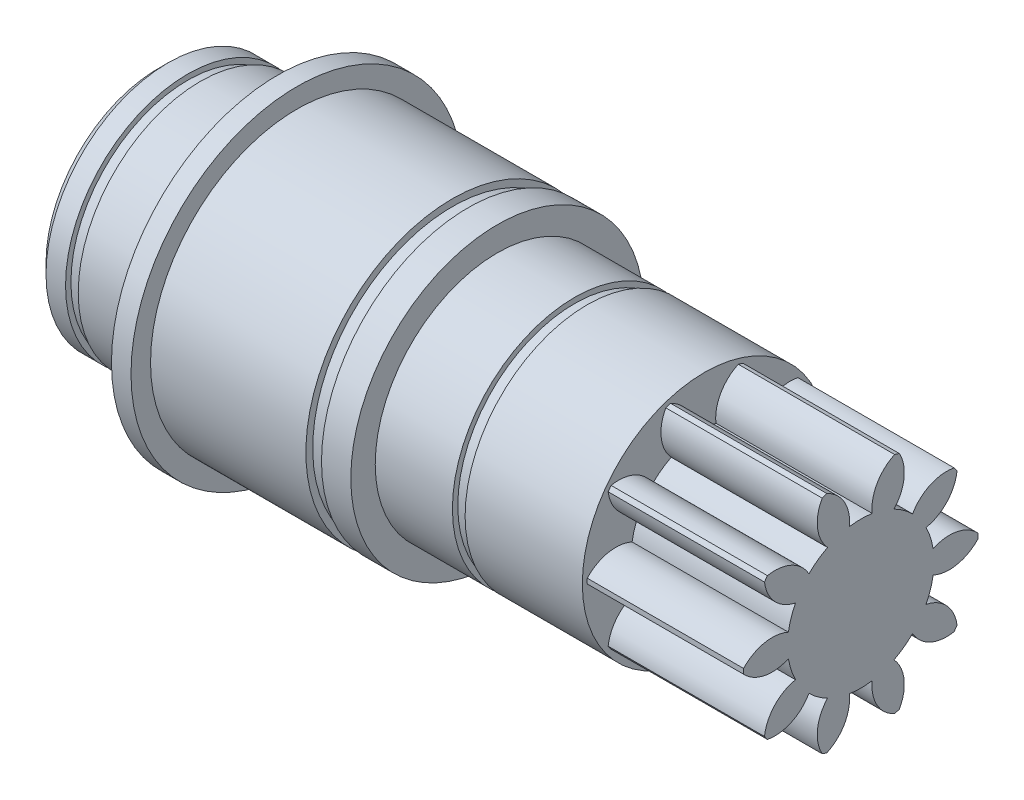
ISO-10303-21;
HEADER;
FILE_DESCRIPTION(('STEP AP214'),'2;1');
FILE_NAME('part.step','',(''),(''),'','','');
FILE_SCHEMA(('AUTOMOTIVE_DESIGN { 1 0 10303 214 1 1 1 1 }'));
ENDSEC;
DATA;
#1=APPLICATION_CONTEXT('core data for automotive mechanical design processes');
#2=APPLICATION_PROTOCOL_DEFINITION('international standard','automotive_design',2000,#1);
#3=PRODUCT_CONTEXT('',#1,'mechanical');
#4=PRODUCT('Part','Part','',(#3));
#5=PRODUCT_RELATED_PRODUCT_CATEGORY('part','',(#4));
#6=PRODUCT_DEFINITION_FORMATION('','',#4);
#7=PRODUCT_DEFINITION_CONTEXT('part definition',#1,'design');
#8=PRODUCT_DEFINITION('design','',#6,#7);
#9=PRODUCT_DEFINITION_SHAPE('','',#8);
#10=(LENGTH_UNIT() NAMED_UNIT(*) SI_UNIT(.MILLI.,.METRE.));
#11=(NAMED_UNIT(*) PLANE_ANGLE_UNIT() SI_UNIT($,.RADIAN.));
#12=(NAMED_UNIT(*) SI_UNIT($,.STERADIAN.) SOLID_ANGLE_UNIT());
#13=UNCERTAINTY_MEASURE_WITH_UNIT(LENGTH_MEASURE(1.E-05),#10,'distance_accuracy_value','');
#14=(GEOMETRIC_REPRESENTATION_CONTEXT(3) GLOBAL_UNCERTAINTY_ASSIGNED_CONTEXT((#13)) GLOBAL_UNIT_ASSIGNED_CONTEXT((#10,
#11,#12)) REPRESENTATION_CONTEXT('',''));
#15=CARTESIAN_POINT('',(0.,0.,0.));
#16=DIRECTION('',(0.,0.,1.));
#17=DIRECTION('',(1.,0.,0.));
#18=AXIS2_PLACEMENT_3D('',#15,#16,#17);
#19=CARTESIAN_POINT('',(-51.6,0.,0.));
#20=DIRECTION('',(-1.,0.,0.));
#21=DIRECTION('',(0.,0.,1.));
#22=AXIS2_PLACEMENT_3D('',#19,#20,#21);
#23=PLANE('',#22);
#24=CARTESIAN_POINT('',(-51.6,0.,0.));
#25=DIRECTION('',(-1.,0.,0.));
#26=DIRECTION('',(0.,0.,1.));
#27=AXIS2_PLACEMENT_3D('',#24,#25,#26);
#28=CIRCLE('',#27,12.5);
#29=CARTESIAN_POINT('',(-51.6,0.,12.5));
#30=VERTEX_POINT('',#29);
#31=EDGE_CURVE('E364',#30,#30,#28,.T.);
#32=ORIENTED_EDGE('',*,*,#31,.T.);
#33=EDGE_LOOP('',(#32));
#34=FACE_BOUND('',#33,.T.);
#35=CARTESIAN_POINT('',(-51.6,0.,0.));
#36=DIRECTION('',(-1.,0.,0.));
#37=DIRECTION('',(0.,0.,1.));
#38=AXIS2_PLACEMENT_3D('',#35,#36,#37);
#39=CIRCLE('',#38,11.95);
#40=CARTESIAN_POINT('',(-51.6,0.,11.95));
#41=VERTEX_POINT('',#40);
#42=EDGE_CURVE('E355',#41,#41,#39,.T.);
#43=ORIENTED_EDGE('',*,*,#42,.F.);
#44=EDGE_LOOP('',(#43));
#45=FACE_BOUND('',#44,.T.);
#46=ADVANCED_FACE('F31',(#34,#45),#23,.T.);
#47=CARTESIAN_POINT('',(-43.7,0.,0.));
#48=DIRECTION('',(-1.,0.,0.));
#49=DIRECTION('',(0.,0.,1.));
#50=AXIS2_PLACEMENT_3D('',#47,#48,#49);
#51=PLANE('',#50);
#52=CARTESIAN_POINT('',(-43.7,0.,0.));
#53=DIRECTION('',(-1.,0.,0.));
#54=DIRECTION('',(0.,0.,1.));
#55=AXIS2_PLACEMENT_3D('',#52,#53,#54);
#56=CIRCLE('',#55,17.);
#57=CARTESIAN_POINT('',(-43.7,0.,17.));
#58=VERTEX_POINT('',#57);
#59=EDGE_CURVE('E370',#58,#58,#56,.T.);
#60=ORIENTED_EDGE('',*,*,#59,.T.);
#61=EDGE_LOOP('',(#60));
#62=FACE_BOUND('',#61,.T.);
#63=CARTESIAN_POINT('',(-43.7,0.,0.));
#64=DIRECTION('',(-1.,0.,0.));
#65=DIRECTION('',(0.,0.,1.));
#66=AXIS2_PLACEMENT_3D('',#63,#64,#65);
#67=CIRCLE('',#66,12.5);
#68=CARTESIAN_POINT('',(-43.7,0.,12.5));
#69=VERTEX_POINT('',#68);
#70=EDGE_CURVE('E361',#69,#69,#67,.T.);
#71=ORIENTED_EDGE('',*,*,#70,.F.);
#72=EDGE_LOOP('',(#71));
#73=FACE_BOUND('',#72,.T.);
#74=ADVANCED_FACE('F687',(#62,#73),#51,.T.);
#75=CARTESIAN_POINT('',(-24.2,0.,0.));
#76=DIRECTION('',(-1.,0.,0.));
#77=DIRECTION('',(0.,0.,1.));
#78=AXIS2_PLACEMENT_3D('',#75,#76,#77);
#79=PLANE('',#78);
#80=CARTESIAN_POINT('',(-24.2,0.,0.));
#81=DIRECTION('',(-1.,0.,0.));
#82=DIRECTION('',(0.,0.,1.));
#83=AXIS2_PLACEMENT_3D('',#80,#81,#82);
#84=CIRCLE('',#83,15.);
#85=CARTESIAN_POINT('',(-24.2,0.,15.));
#86=VERTEX_POINT('',#85);
#87=EDGE_CURVE('E388',#86,#86,#84,.T.);
#88=ORIENTED_EDGE('',*,*,#87,.T.);
#89=EDGE_LOOP('',(#88));
#90=FACE_BOUND('',#89,.T.);
#91=CARTESIAN_POINT('',(-24.2,0.,0.));
#92=DIRECTION('',(-1.,0.,0.));
#93=DIRECTION('',(0.,0.,1.));
#94=AXIS2_PLACEMENT_3D('',#91,#92,#93);
#95=CIRCLE('',#94,14.3);
#96=CARTESIAN_POINT('',(-24.2,0.,14.3));
#97=VERTEX_POINT('',#96);
#98=EDGE_CURVE('E379',#97,#97,#95,.T.);
#99=ORIENTED_EDGE('',*,*,#98,.F.);
#100=EDGE_LOOP('',(#99));
#101=FACE_BOUND('',#100,.T.);
#102=ADVANCED_FACE('F695',(#90,#101),#79,.T.);
#103=CARTESIAN_POINT('',(-12.,0.,0.));
#104=DIRECTION('',(-1.,0.,0.));
#105=DIRECTION('',(0.,0.,1.));
#106=AXIS2_PLACEMENT_3D('',#103,#104,#105);
#107=PLANE('',#106);
#108=CARTESIAN_POINT('',(-12.,0.,0.));
#109=DIRECTION('',(-1.,0.,0.));
#110=DIRECTION('',(0.,0.,1.));
#111=AXIS2_PLACEMENT_3D('',#108,#109,#110);
#112=CIRCLE('',#111,12.5);
#113=CARTESIAN_POINT('',(-12.,0.,12.5));
#114=VERTEX_POINT('',#113);
#115=EDGE_CURVE('E406',#114,#114,#112,.T.);
#116=ORIENTED_EDGE('',*,*,#115,.T.);
#117=EDGE_LOOP('',(#116));
#118=FACE_BOUND('',#117,.T.);
#119=CARTESIAN_POINT('',(-12.,0.,0.));
#120=DIRECTION('',(-1.,0.,0.));
#121=DIRECTION('',(0.,0.,1.));
#122=AXIS2_PLACEMENT_3D('',#119,#120,#121);
#123=CIRCLE('',#122,11.95);
#124=CARTESIAN_POINT('',(-12.,0.,11.95));
#125=VERTEX_POINT('',#124);
#126=EDGE_CURVE('E397',#125,#125,#123,.T.);
#127=ORIENTED_EDGE('',*,*,#126,.F.);
#128=EDGE_LOOP('',(#127));
#129=FACE_BOUND('',#128,.T.);
#130=ADVANCED_FACE('F728',(#118,#129),#107,.T.);
#131=CARTESIAN_POINT('',(16.,0.,0.));
#132=DIRECTION('',(-1.,0.,0.));
#133=DIRECTION('',(0.,0.,1.));
#134=AXIS2_PLACEMENT_3D('',#131,#132,#133);
#135=PLANE('',#134);
#136=CARTESIAN_POINT('',(16.,2.46642274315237,9.06746828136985));
#137=DIRECTION('',(-1.,0.,0.));
#138=DIRECTION('',(0.,0.951056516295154,0.309016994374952));
#139=AXIS2_PLACEMENT_3D('',#136,#137,#138);
#140=CIRCLE('',#139,4.);
#141=CARTESIAN_POINT('',(16.,-1.17254140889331,7.40676364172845));
#142=VERTEX_POINT('',#141);
#143=CARTESIAN_POINT('',(16.,-0.256880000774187,11.9972502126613));
#144=VERTEX_POINT('',#143);
#145=EDGE_CURVE('E542',#142,#144,#140,.T.);
#146=ORIENTED_EDGE('',*,*,#145,.F.);
#147=CARTESIAN_POINT('',(16.,0.,0.));
#148=DIRECTION('',(-1.,0.,0.));
#149=DIRECTION('',(0.,0.951056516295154,0.309016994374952));
#150=AXIS2_PLACEMENT_3D('',#147,#148,#149);
#151=CIRCLE('',#150,7.499);
#152=CARTESIAN_POINT('',(16.,-3.40498050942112,6.68140020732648));
#153=VERTEX_POINT('',#152);
#154=EDGE_CURVE('E546',#153,#142,#151,.T.);
#155=ORIENTED_EDGE('',*,*,#154,.F.);
#156=CARTESIAN_POINT('',(16.,-7.32510204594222,5.88600902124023));
#157=DIRECTION('',(-1.,0.,0.));
#158=DIRECTION('',(0.,0.951056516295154,0.309016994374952));
#159=AXIS2_PLACEMENT_3D('',#156,#157,#158);
#160=CIRCLE('',#159,4.);
#161=CARTESIAN_POINT('',(16.,-6.84398645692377,9.85696958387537));
#162=VERTEX_POINT('',#161);
#163=EDGE_CURVE('E544',#162,#153,#160,.T.);
#164=ORIENTED_EDGE('',*,*,#163,.F.);
#165=CARTESIAN_POINT('',(16.,0.,0.));
#166=DIRECTION('',(-1.,0.,0.));
#167=DIRECTION('',(0.,0.,1.));
#168=AXIS2_PLACEMENT_3D('',#165,#166,#167);
#169=CIRCLE('',#168,12.);
#170=CARTESIAN_POINT('',(16.,-7.25962702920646,9.55498903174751));
#171=VERTEX_POINT('',#170);
#172=EDGE_CURVE('E921',#171,#162,#169,.T.);
#173=ORIENTED_EDGE('',*,*,#172,.F.);
#174=CARTESIAN_POINT('',(16.,-3.33434621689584,8.7854628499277));
#175=DIRECTION('',(-1.,0.,0.));
#176=DIRECTION('',(0.,0.587785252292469,0.809016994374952));
#177=AXIS2_PLACEMENT_3D('',#174,#175,#176);
#178=CIRCLE('',#177,4.);
#179=CARTESIAN_POINT('',(16.,-5.30219236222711,5.30299511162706));
#180=VERTEX_POINT('',#179);
#181=EDGE_CURVE('E520',#180,#171,#178,.T.);
#182=ORIENTED_EDGE('',*,*,#181,.F.);
#183=CARTESIAN_POINT('',(16.,0.,0.));
#184=DIRECTION('',(-1.,0.,0.));
#185=DIRECTION('',(0.,0.587785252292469,0.809016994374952));
#186=AXIS2_PLACEMENT_3D('',#183,#184,#185);
#187=CIRCLE('',#186,7.499);
#188=CARTESIAN_POINT('',(16.,-6.68191560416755,3.40396898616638));
#189=VERTEX_POINT('',#188);
#190=EDGE_CURVE('E524',#189,#180,#187,.T.);
#191=ORIENTED_EDGE('',*,*,#190,.F.);
#192=CARTESIAN_POINT('',(16.,-9.38584133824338,0.456294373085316));
#193=DIRECTION('',(-1.,0.,0.));
#194=DIRECTION('',(0.,0.587785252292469,0.809016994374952));
#195=AXIS2_PLACEMENT_3D('',#192,#193,#194);
#196=CIRCLE('',#195,4.);
#197=CARTESIAN_POINT('',(16.,-11.3306827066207,3.95166160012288));
#198=VERTEX_POINT('',#197);
#199=EDGE_CURVE('E522',#198,#189,#196,.T.);
#200=ORIENTED_EDGE('',*,*,#199,.F.);
#201=CARTESIAN_POINT('',(16.,-11.4894432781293,3.46304680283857));
#202=VERTEX_POINT('',#201);
#203=EDGE_CURVE('E916',#202,#198,#169,.T.);
#204=ORIENTED_EDGE('',*,*,#203,.F.);
#205=CARTESIAN_POINT('',(16.,-7.86150825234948,5.1477092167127));
#206=DIRECTION('',(-1.,0.,0.));
#207=DIRECTION('',(0.,0.,1.));
#208=AXIS2_PLACEMENT_3D('',#205,#206,#207);
#209=CIRCLE('',#208,4.);
#210=CARTESIAN_POINT('',(16.,-7.40658604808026,1.17366269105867));
#211=VERTEX_POINT('',#210);
#212=EDGE_CURVE('E498',#211,#202,#209,.T.);
#213=ORIENTED_EDGE('',*,*,#212,.F.);
#214=CARTESIAN_POINT('',(16.,0.,0.));
#215=DIRECTION('',(-1.,0.,0.));
#216=DIRECTION('',(0.,0.,1.));
#217=AXIS2_PLACEMENT_3D('',#214,#215,#216);
#218=CIRCLE('',#217,7.499);
#219=CARTESIAN_POINT('',(16.,-7.40658604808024,-1.17366269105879));
#220=VERTEX_POINT('',#219);
#221=EDGE_CURVE('E502',#220,#211,#218,.T.);
#222=ORIENTED_EDGE('',*,*,#221,.F.);
#223=CARTESIAN_POINT('',(16.,-7.86150825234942,-5.14770921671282));
#224=DIRECTION('',(-1.,0.,0.));
#225=DIRECTION('',(0.,0.,1.));
#226=AXIS2_PLACEMENT_3D('',#223,#224,#225);
#227=CIRCLE('',#226,4.);
#228=CARTESIAN_POINT('',(16.,-11.4894432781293,-3.46304680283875));
#229=VERTEX_POINT('',#228);
#230=EDGE_CURVE('E500',#229,#220,#227,.T.);
#231=ORIENTED_EDGE('',*,*,#230,.F.);
#232=CARTESIAN_POINT('',(16.,-11.3306827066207,-3.95166160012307));
#233=VERTEX_POINT('',#232);
#234=EDGE_CURVE('E911',#233,#229,#169,.T.);
#235=ORIENTED_EDGE('',*,*,#234,.F.);
#236=CARTESIAN_POINT('',(16.,-9.38584133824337,-0.456294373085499));
#237=DIRECTION('',(-1.,0.,0.));
#238=DIRECTION('',(0.,-0.587785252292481,0.809016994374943));
#239=AXIS2_PLACEMENT_3D('',#236,#237,#238);
#240=CIRCLE('',#239,4.);
#241=CARTESIAN_POINT('',(16.,-6.68191560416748,-3.40396898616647));
#242=VERTEX_POINT('',#241);
#243=EDGE_CURVE('E476',#242,#233,#240,.T.);
#244=ORIENTED_EDGE('',*,*,#243,.F.);
#245=CARTESIAN_POINT('',(16.,0.,0.));
#246=DIRECTION('',(-1.,0.,0.));
#247=DIRECTION('',(0.,-0.587785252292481,0.809016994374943));
#248=AXIS2_PLACEMENT_3D('',#245,#246,#247);
#249=CIRCLE('',#248,7.499);
#250=CARTESIAN_POINT('',(16.,-5.30219236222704,-5.30299511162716));
#251=VERTEX_POINT('',#250);
#252=EDGE_CURVE('E480',#251,#242,#249,.T.);
#253=ORIENTED_EDGE('',*,*,#252,.F.);
#254=CARTESIAN_POINT('',(16.,-3.33434621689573,-8.78546284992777));
#255=DIRECTION('',(-1.,0.,0.));
#256=DIRECTION('',(0.,-0.587785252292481,0.809016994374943));
#257=AXIS2_PLACEMENT_3D('',#254,#255,#256);
#258=CIRCLE('',#257,4.);
#259=CARTESIAN_POINT('',(16.,-7.25962702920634,-9.55498903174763));
#260=VERTEX_POINT('',#259);
#261=EDGE_CURVE('E478',#260,#251,#258,.T.);
#262=ORIENTED_EDGE('',*,*,#261,.F.);
#263=CARTESIAN_POINT('',(16.,-6.84398645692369,-9.85696958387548));
#264=VERTEX_POINT('',#263);
#265=EDGE_CURVE('E906',#264,#260,#169,.T.);
#266=ORIENTED_EDGE('',*,*,#265,.F.);
#267=CARTESIAN_POINT('',(16.,-7.32510204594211,-5.88600902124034));
#268=DIRECTION('',(-1.,0.,0.));
#269=DIRECTION('',(0.,-0.951056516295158,0.309016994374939));
#270=AXIS2_PLACEMENT_3D('',#267,#268,#269);
#271=CIRCLE('',#270,4.);
#272=CARTESIAN_POINT('',(16.,-3.40498050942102,-6.68140020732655));
#273=VERTEX_POINT('',#272);
#274=EDGE_CURVE('E454',#273,#264,#271,.T.);
#275=ORIENTED_EDGE('',*,*,#274,.F.);
#276=CARTESIAN_POINT('',(16.,0.,0.));
#277=DIRECTION('',(-1.,0.,0.));
#278=DIRECTION('',(0.,-0.951056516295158,0.309016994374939));
#279=AXIS2_PLACEMENT_3D('',#276,#277,#278);
#280=CIRCLE('',#279,7.499);
#281=CARTESIAN_POINT('',(16.,-1.17254140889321,-7.40676364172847));
#282=VERTEX_POINT('',#281);
#283=EDGE_CURVE('E458',#282,#273,#280,.T.);
#284=ORIENTED_EDGE('',*,*,#283,.F.);
#285=CARTESIAN_POINT('',(16.,2.46642274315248,-9.06746828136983));
#286=DIRECTION('',(-1.,0.,0.));
#287=DIRECTION('',(0.,-0.951056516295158,0.309016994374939));
#288=AXIS2_PLACEMENT_3D('',#285,#286,#287);
#289=CIRCLE('',#288,4.);
#290=CARTESIAN_POINT('',(16.,-0.256880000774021,-11.9972502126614));
#291=VERTEX_POINT('',#290);
#292=EDGE_CURVE('E456',#291,#282,#289,.T.);
#293=ORIENTED_EDGE('',*,*,#292,.F.);
#294=CARTESIAN_POINT('',(16.,0.256880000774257,-11.9972502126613));
#295=VERTEX_POINT('',#294);
#296=EDGE_CURVE('E905',#295,#291,#169,.T.);
#297=ORIENTED_EDGE('',*,*,#296,.F.);
#298=CARTESIAN_POINT('',(16.,-2.46642274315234,-9.06746828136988));
#299=DIRECTION('',(-1.,0.,0.));
#300=DIRECTION('',(0.,-0.951056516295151,-0.309016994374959));
#301=AXIS2_PLACEMENT_3D('',#298,#299,#300);
#302=CIRCLE('',#301,4.);
#303=CARTESIAN_POINT('',(16.,1.17254140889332,-7.40676364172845));
#304=VERTEX_POINT('',#303);
#305=EDGE_CURVE('E433',#304,#295,#302,.T.);
#306=ORIENTED_EDGE('',*,*,#305,.F.);
#307=CARTESIAN_POINT('',(16.,0.,0.));
#308=DIRECTION('',(-1.,0.,0.));
#309=DIRECTION('',(0.,-0.951056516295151,-0.309016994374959));
#310=AXIS2_PLACEMENT_3D('',#307,#308,#309);
#311=CIRCLE('',#310,7.499);
#312=CARTESIAN_POINT('',(16.,3.40498050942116,-6.68140020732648));
#313=VERTEX_POINT('',#312);
#314=EDGE_CURVE('E437',#313,#304,#311,.T.);
#315=ORIENTED_EDGE('',*,*,#314,.F.);
#316=CARTESIAN_POINT('',(16.,7.32510204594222,-5.88600902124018));
#317=DIRECTION('',(-1.,0.,0.));
#318=DIRECTION('',(0.,-0.951056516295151,-0.309016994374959));
#319=AXIS2_PLACEMENT_3D('',#316,#317,#318);
#320=CIRCLE('',#319,4.);
#321=CARTESIAN_POINT('',(16.,6.84398645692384,-9.85696958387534));
#322=VERTEX_POINT('',#321);
#323=EDGE_CURVE('E435',#322,#313,#320,.T.);
#324=ORIENTED_EDGE('',*,*,#323,.F.);
#325=CARTESIAN_POINT('',(16.,7.25962702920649,-9.55498903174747));
#326=VERTEX_POINT('',#325);
#327=EDGE_CURVE('E634',#326,#322,#169,.T.);
#328=ORIENTED_EDGE('',*,*,#327,.F.);
#329=CARTESIAN_POINT('',(16.,3.33434621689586,-8.78546284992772));
#330=DIRECTION('',(-1.,0.,0.));
#331=DIRECTION('',(0.,-0.587785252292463,-0.809016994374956));
#332=AXIS2_PLACEMENT_3D('',#329,#330,#331);
#333=CIRCLE('',#332,4.);
#334=CARTESIAN_POINT('',(16.,5.30219236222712,-5.30299511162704));
#335=VERTEX_POINT('',#334);
#336=EDGE_CURVE('E415',#335,#326,#333,.T.);
#337=ORIENTED_EDGE('',*,*,#336,.F.);
#338=CARTESIAN_POINT('',(16.,0.,0.));
#339=DIRECTION('',(-1.,0.,0.));
#340=DIRECTION('',(0.,-0.587785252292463,-0.809016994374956));
#341=AXIS2_PLACEMENT_3D('',#338,#339,#340);
#342=CIRCLE('',#341,7.499);
#343=CARTESIAN_POINT('',(16.,6.68191560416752,-3.40396898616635));
#344=VERTEX_POINT('',#343);
#345=EDGE_CURVE('E419',#344,#335,#342,.T.);
#346=ORIENTED_EDGE('',*,*,#345,.F.);
#347=CARTESIAN_POINT('',(16.,9.38584133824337,-0.456294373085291));
#348=DIRECTION('',(-1.,0.,0.));
#349=DIRECTION('',(0.,-0.587785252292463,-0.809016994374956));
#350=AXIS2_PLACEMENT_3D('',#347,#348,#349);
#351=CIRCLE('',#350,4.);
#352=CARTESIAN_POINT('',(16.,11.3306827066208,-3.95166160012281));
#353=VERTEX_POINT('',#352);
#354=EDGE_CURVE('E417',#353,#344,#351,.T.);
#355=ORIENTED_EDGE('',*,*,#354,.F.);
#356=CARTESIAN_POINT('',(16.,11.4894432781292,-3.46304680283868));
#357=VERTEX_POINT('',#356);
#358=EDGE_CURVE('E630',#357,#353,#169,.T.);
#359=ORIENTED_EDGE('',*,*,#358,.F.);
#360=CARTESIAN_POINT('',(16.,7.86150825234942,-5.14770921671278));
#361=DIRECTION('',(-1.,0.,0.));
#362=DIRECTION('',(0.,0.,-1.));
#363=AXIS2_PLACEMENT_3D('',#360,#361,#362);
#364=CIRCLE('',#363,4.);
#365=CARTESIAN_POINT('',(16.,7.40658604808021,-1.17366269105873));
#366=VERTEX_POINT('',#365);
#367=EDGE_CURVE('E608',#366,#357,#364,.T.);
#368=ORIENTED_EDGE('',*,*,#367,.F.);
#369=CARTESIAN_POINT('',(16.,0.,0.));
#370=DIRECTION('',(-1.,0.,0.));
#371=DIRECTION('',(0.,0.,-1.));
#372=AXIS2_PLACEMENT_3D('',#369,#370,#371);
#373=CIRCLE('',#372,7.499);
#374=CARTESIAN_POINT('',(16.,7.40658604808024,1.17366269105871));
#375=VERTEX_POINT('',#374);
#376=EDGE_CURVE('E612',#375,#366,#373,.T.);
#377=ORIENTED_EDGE('',*,*,#376,.F.);
#378=CARTESIAN_POINT('',(16.,7.86150825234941,5.14770921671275));
#379=DIRECTION('',(-1.,0.,0.));
#380=DIRECTION('',(0.,0.,-1.));
#381=AXIS2_PLACEMENT_3D('',#378,#379,#380);
#382=CIRCLE('',#381,4.);
#383=CARTESIAN_POINT('',(16.,11.4894432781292,3.46304680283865));
#384=VERTEX_POINT('',#383);
#385=EDGE_CURVE('E610',#384,#375,#382,.T.);
#386=ORIENTED_EDGE('',*,*,#385,.F.);
#387=CARTESIAN_POINT('',(16.,11.3306827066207,3.95166160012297));
#388=VERTEX_POINT('',#387);
#389=EDGE_CURVE('E628',#388,#384,#169,.T.);
#390=ORIENTED_EDGE('',*,*,#389,.F.);
#391=CARTESIAN_POINT('',(16.,9.38584133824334,0.456294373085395));
#392=DIRECTION('',(-1.,0.,0.));
#393=DIRECTION('',(0.,0.587785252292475,-0.809016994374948));
#394=AXIS2_PLACEMENT_3D('',#391,#392,#393);
#395=CIRCLE('',#394,4.);
#396=CARTESIAN_POINT('',(16.,6.68191560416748,3.40396898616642));
#397=VERTEX_POINT('',#396);
#398=EDGE_CURVE('E586',#397,#388,#395,.T.);
#399=ORIENTED_EDGE('',*,*,#398,.F.);
#400=CARTESIAN_POINT('',(16.,0.,0.));
#401=DIRECTION('',(-1.,0.,0.));
#402=DIRECTION('',(0.,0.587785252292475,-0.809016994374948));
#403=AXIS2_PLACEMENT_3D('',#400,#401,#402);
#404=CIRCLE('',#403,7.499);
#405=CARTESIAN_POINT('',(16.,5.30219236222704,5.3029951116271));
#406=VERTEX_POINT('',#405);
#407=EDGE_CURVE('E590',#406,#397,#404,.T.);
#408=ORIENTED_EDGE('',*,*,#407,.F.);
#409=CARTESIAN_POINT('',(16.,3.33434621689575,8.78546284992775));
#410=DIRECTION('',(-1.,0.,0.));
#411=DIRECTION('',(0.,0.587785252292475,-0.809016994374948));
#412=AXIS2_PLACEMENT_3D('',#409,#410,#411);
#413=CIRCLE('',#412,4.);
#414=CARTESIAN_POINT('',(16.,7.25962702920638,9.55498903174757));
#415=VERTEX_POINT('',#414);
#416=EDGE_CURVE('E588',#415,#406,#413,.T.);
#417=ORIENTED_EDGE('',*,*,#416,.F.);
#418=CARTESIAN_POINT('',(16.,6.84398645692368,9.8569695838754));
#419=VERTEX_POINT('',#418);
#420=EDGE_CURVE('E931',#419,#415,#169,.T.);
#421=ORIENTED_EDGE('',*,*,#420,.F.);
#422=CARTESIAN_POINT('',(16.,7.32510204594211,5.88600902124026));
#423=DIRECTION('',(-1.,0.,0.));
#424=DIRECTION('',(0.,0.951056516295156,-0.309016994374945));
#425=AXIS2_PLACEMENT_3D('',#422,#423,#424);
#426=CIRCLE('',#425,4.);
#427=CARTESIAN_POINT('',(16.,3.40498050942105,6.6814002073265));
#428=VERTEX_POINT('',#427);
#429=EDGE_CURVE('E564',#428,#419,#426,.T.);
#430=ORIENTED_EDGE('',*,*,#429,.F.);
#431=CARTESIAN_POINT('',(16.,0.,0.));
#432=DIRECTION('',(-1.,0.,0.));
#433=DIRECTION('',(0.,0.951056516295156,-0.309016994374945));
#434=AXIS2_PLACEMENT_3D('',#431,#432,#433);
#435=CIRCLE('',#434,7.499);
#436=CARTESIAN_POINT('',(16.,1.17254140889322,7.40676364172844));
#437=VERTEX_POINT('',#436);
#438=EDGE_CURVE('E568',#437,#428,#435,.T.);
#439=ORIENTED_EDGE('',*,*,#438,.F.);
#440=CARTESIAN_POINT('',(16.,-2.46642274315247,9.06746828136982));
#441=DIRECTION('',(-1.,0.,0.));
#442=DIRECTION('',(0.,0.951056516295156,-0.309016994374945));
#443=AXIS2_PLACEMENT_3D('',#440,#441,#442);
#444=CIRCLE('',#443,4.);
#445=CARTESIAN_POINT('',(16.,0.25688000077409,11.9972502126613));
#446=VERTEX_POINT('',#445);
#447=EDGE_CURVE('E566',#446,#437,#444,.T.);
#448=ORIENTED_EDGE('',*,*,#447,.F.);
#449=EDGE_CURVE('E926',#144,#446,#169,.T.);
#450=ORIENTED_EDGE('',*,*,#449,.F.);
#451=EDGE_LOOP('',(#146,#155,#164,#173,#182,#191,#200,#204,#213,#222,#231,#235,#244,#253,#262,
#266,#275,#284,#293,#297,#306,#315,#324,#328,#337,#346,#355,#359,#368,#377,#386,#390,#399,#408,
#417,#421,#430,#439,#448,#450));
#452=FACE_BOUND('',#451,.T.);
#453=ADVANCED_FACE('F33',(#452),#135,.F.);
#454=CARTESIAN_POINT('',(-10.,0.,0.));
#455=DIRECTION('',(-1.,0.,0.));
#456=DIRECTION('',(0.,0.,1.));
#457=AXIS2_PLACEMENT_3D('',#454,#455,#456);
#458=CYLINDRICAL_SURFACE('',#457,12.);
#459=DIRECTION('',(-1.,0.,0.));
#460=VECTOR('',#459,1.);
#461=CARTESIAN_POINT('',(8.,7.2596270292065,-9.55498903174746));
#462=LINE('',#461,#460);
#463=CARTESIAN_POINT('',(0.,7.2596270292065,-9.55498903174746));
#464=VERTEX_POINT('',#463);
#465=EDGE_CURVE('E427',#326,#464,#462,.T.);
#466=ORIENTED_EDGE('',*,*,#465,.F.);
#467=ORIENTED_EDGE('',*,*,#327,.T.);
#468=DIRECTION('',(-1.,0.,0.));
#469=VECTOR('',#468,1.);
#470=CARTESIAN_POINT('',(8.,6.84398645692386,-9.85696958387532));
#471=LINE('',#470,#469);
#472=CARTESIAN_POINT('',(0.,6.84398645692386,-9.85696958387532));
#473=VERTEX_POINT('',#472);
#474=EDGE_CURVE('E443',#473,#322,#471,.F.);
#475=ORIENTED_EDGE('',*,*,#474,.F.);
#476=CARTESIAN_POINT('',(0.,0.,0.));
#477=DIRECTION('',(-1.,0.,0.));
#478=DIRECTION('',(0.,0.,1.));
#479=AXIS2_PLACEMENT_3D('',#476,#477,#478);
#480=CIRCLE('',#479,12.);
#481=EDGE_CURVE('E629',#464,#473,#480,.T.);
#482=ORIENTED_EDGE('',*,*,#481,.F.);
#483=EDGE_LOOP('',(#466,#467,#475,#482));
#484=FACE_BOUND('',#483,.T.);
#485=ADVANCED_FACE('F877',(#484),#458,.T.);
#486=DIRECTION('',(-1.,0.,0.));
#487=VECTOR('',#486,1.);
#488=CARTESIAN_POINT('',(8.,11.3306827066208,-3.95166160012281));
#489=LINE('',#488,#487);
#490=CARTESIAN_POINT('',(0.,11.3306827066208,-3.95166160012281));
#491=VERTEX_POINT('',#490);
#492=EDGE_CURVE('E425',#491,#353,#489,.F.);
#493=ORIENTED_EDGE('',*,*,#492,.F.);
#494=CARTESIAN_POINT('',(0.,11.4894432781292,-3.46304680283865));
#495=VERTEX_POINT('',#494);
#496=EDGE_CURVE('E625',#495,#491,#480,.T.);
#497=ORIENTED_EDGE('',*,*,#496,.F.);
#498=DIRECTION('',(-1.,0.,0.));
#499=VECTOR('',#498,1.);
#500=CARTESIAN_POINT('',(8.,11.4894432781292,-3.46304680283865));
#501=LINE('',#500,#499);
#502=EDGE_CURVE('E622',#357,#495,#501,.T.);
#503=ORIENTED_EDGE('',*,*,#502,.F.);
#504=ORIENTED_EDGE('',*,*,#358,.T.);
#505=EDGE_LOOP('',(#493,#497,#503,#504));
#506=FACE_BOUND('',#505,.T.);
#507=ADVANCED_FACE('F885',(#506),#458,.T.);
#508=DIRECTION('',(-1.,0.,0.));
#509=VECTOR('',#508,1.);
#510=CARTESIAN_POINT('',(8.,0.256880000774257,-11.9972502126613));
#511=LINE('',#510,#509);
#512=CARTESIAN_POINT('',(0.,0.256880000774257,-11.9972502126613));
#513=VERTEX_POINT('',#512);
#514=EDGE_CURVE('E446',#295,#513,#511,.T.);
#515=ORIENTED_EDGE('',*,*,#514,.F.);
#516=ORIENTED_EDGE('',*,*,#296,.T.);
#517=DIRECTION('',(-1.,0.,0.));
#518=VECTOR('',#517,1.);
#519=CARTESIAN_POINT('',(8.,-0.256880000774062,-11.9972502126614));
#520=LINE('',#519,#518);
#521=CARTESIAN_POINT('',(0.,-0.256880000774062,-11.9972502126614));
#522=VERTEX_POINT('',#521);
#523=EDGE_CURVE('E465',#522,#291,#520,.F.);
#524=ORIENTED_EDGE('',*,*,#523,.F.);
#525=EDGE_CURVE('E978',#513,#522,#480,.T.);
#526=ORIENTED_EDGE('',*,*,#525,.F.);
#527=EDGE_LOOP('',(#515,#516,#524,#526));
#528=FACE_BOUND('',#527,.T.);
#529=ADVANCED_FACE('F890',(#528),#458,.T.);
#530=DIRECTION('',(-1.,0.,0.));
#531=VECTOR('',#530,1.);
#532=CARTESIAN_POINT('',(8.,-6.84398645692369,-9.85696958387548));
#533=LINE('',#532,#531);
#534=CARTESIAN_POINT('',(0.,-6.84398645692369,-9.85696958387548));
#535=VERTEX_POINT('',#534);
#536=EDGE_CURVE('E468',#264,#535,#533,.T.);
#537=ORIENTED_EDGE('',*,*,#536,.F.);
#538=ORIENTED_EDGE('',*,*,#265,.T.);
#539=DIRECTION('',(-1.,0.,0.));
#540=VECTOR('',#539,1.);
#541=CARTESIAN_POINT('',(8.,-7.25962702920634,-9.55498903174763));
#542=LINE('',#541,#540);
#543=CARTESIAN_POINT('',(0.,-7.25962702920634,-9.55498903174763));
#544=VERTEX_POINT('',#543);
#545=EDGE_CURVE('E487',#544,#260,#542,.F.);
#546=ORIENTED_EDGE('',*,*,#545,.F.);
#547=EDGE_CURVE('E974',#535,#544,#480,.T.);
#548=ORIENTED_EDGE('',*,*,#547,.F.);
#549=EDGE_LOOP('',(#537,#538,#546,#548));
#550=FACE_BOUND('',#549,.T.);
#551=ADVANCED_FACE('F1000',(#550),#458,.T.);
#552=DIRECTION('',(-1.,0.,0.));
#553=VECTOR('',#552,1.);
#554=CARTESIAN_POINT('',(8.,-11.3306827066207,-3.95166160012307));
#555=LINE('',#554,#553);
#556=CARTESIAN_POINT('',(0.,-11.3306827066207,-3.95166160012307));
#557=VERTEX_POINT('',#556);
#558=EDGE_CURVE('E490',#233,#557,#555,.T.);
#559=ORIENTED_EDGE('',*,*,#558,.F.);
#560=ORIENTED_EDGE('',*,*,#234,.T.);
#561=DIRECTION('',(-1.,0.,0.));
#562=VECTOR('',#561,1.);
#563=CARTESIAN_POINT('',(8.,-11.4894432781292,-3.46304680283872));
#564=LINE('',#563,#562);
#565=CARTESIAN_POINT('',(0.,-11.4894432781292,-3.46304680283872));
#566=VERTEX_POINT('',#565);
#567=EDGE_CURVE('E509',#566,#229,#564,.F.);
#568=ORIENTED_EDGE('',*,*,#567,.F.);
#569=EDGE_CURVE('E970',#557,#566,#480,.T.);
#570=ORIENTED_EDGE('',*,*,#569,.F.);
#571=EDGE_LOOP('',(#559,#560,#568,#570));
#572=FACE_BOUND('',#571,.T.);
#573=ADVANCED_FACE('F1004',(#572),#458,.T.);
#574=DIRECTION('',(-1.,0.,0.));
#575=VECTOR('',#574,1.);
#576=CARTESIAN_POINT('',(8.,-11.4894432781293,3.46304680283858));
#577=LINE('',#576,#575);
#578=CARTESIAN_POINT('',(0.,-11.4894432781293,3.46304680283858));
#579=VERTEX_POINT('',#578);
#580=EDGE_CURVE('E512',#202,#579,#577,.T.);
#581=ORIENTED_EDGE('',*,*,#580,.F.);
#582=ORIENTED_EDGE('',*,*,#203,.T.);
#583=DIRECTION('',(-1.,0.,0.));
#584=VECTOR('',#583,1.);
#585=CARTESIAN_POINT('',(8.,-11.3306827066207,3.95166160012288));
#586=LINE('',#585,#584);
#587=CARTESIAN_POINT('',(0.,-11.3306827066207,3.95166160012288));
#588=VERTEX_POINT('',#587);
#589=EDGE_CURVE('E531',#588,#198,#586,.F.);
#590=ORIENTED_EDGE('',*,*,#589,.F.);
#591=EDGE_CURVE('E966',#579,#588,#480,.T.);
#592=ORIENTED_EDGE('',*,*,#591,.F.);
#593=EDGE_LOOP('',(#581,#582,#590,#592));
#594=FACE_BOUND('',#593,.T.);
#595=ADVANCED_FACE('F1008',(#594),#458,.T.);
#596=DIRECTION('',(-1.,0.,0.));
#597=VECTOR('',#596,1.);
#598=CARTESIAN_POINT('',(8.,-7.25962702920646,9.55498903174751));
#599=LINE('',#598,#597);
#600=CARTESIAN_POINT('',(0.,-7.25962702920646,9.55498903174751));
#601=VERTEX_POINT('',#600);
#602=EDGE_CURVE('E534',#171,#601,#599,.T.);
#603=ORIENTED_EDGE('',*,*,#602,.F.);
#604=ORIENTED_EDGE('',*,*,#172,.T.);
#605=DIRECTION('',(-1.,0.,0.));
#606=VECTOR('',#605,1.);
#607=CARTESIAN_POINT('',(8.,-6.84398645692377,9.85696958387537));
#608=LINE('',#607,#606);
#609=CARTESIAN_POINT('',(0.,-6.84398645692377,9.85696958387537));
#610=VERTEX_POINT('',#609);
#611=EDGE_CURVE('E553',#610,#162,#608,.F.);
#612=ORIENTED_EDGE('',*,*,#611,.F.);
#613=EDGE_CURVE('E962',#601,#610,#480,.T.);
#614=ORIENTED_EDGE('',*,*,#613,.F.);
#615=EDGE_LOOP('',(#603,#604,#612,#614));
#616=FACE_BOUND('',#615,.T.);
#617=ADVANCED_FACE('F1027',(#616),#458,.T.);
#618=DIRECTION('',(-1.,0.,0.));
#619=VECTOR('',#618,1.);
#620=CARTESIAN_POINT('',(8.,-0.256880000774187,11.9972502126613));
#621=LINE('',#620,#619);
#622=CARTESIAN_POINT('',(0.,-0.256880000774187,11.9972502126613));
#623=VERTEX_POINT('',#622);
#624=EDGE_CURVE('E556',#144,#623,#621,.T.);
#625=ORIENTED_EDGE('',*,*,#624,.F.);
#626=ORIENTED_EDGE('',*,*,#449,.T.);
#627=DIRECTION('',(-1.,0.,0.));
#628=VECTOR('',#627,1.);
#629=CARTESIAN_POINT('',(8.,0.25688000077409,11.9972502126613));
#630=LINE('',#629,#628);
#631=CARTESIAN_POINT('',(0.,0.25688000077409,11.9972502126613));
#632=VERTEX_POINT('',#631);
#633=EDGE_CURVE('E575',#632,#446,#630,.F.);
#634=ORIENTED_EDGE('',*,*,#633,.F.);
#635=EDGE_CURVE('E958',#623,#632,#480,.T.);
#636=ORIENTED_EDGE('',*,*,#635,.F.);
#637=EDGE_LOOP('',(#625,#626,#634,#636));
#638=FACE_BOUND('',#637,.T.);
#639=ADVANCED_FACE('F881',(#638),#458,.T.);
#640=DIRECTION('',(-1.,0.,0.));
#641=VECTOR('',#640,1.);
#642=CARTESIAN_POINT('',(8.,6.84398645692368,9.8569695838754));
#643=LINE('',#642,#641);
#644=CARTESIAN_POINT('',(0.,6.84398645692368,9.8569695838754));
#645=VERTEX_POINT('',#644);
#646=EDGE_CURVE('E578',#419,#645,#643,.T.);
#647=ORIENTED_EDGE('',*,*,#646,.F.);
#648=ORIENTED_EDGE('',*,*,#420,.T.);
#649=DIRECTION('',(-1.,0.,0.));
#650=VECTOR('',#649,1.);
#651=CARTESIAN_POINT('',(8.,7.25962702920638,9.55498903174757));
#652=LINE('',#651,#650);
#653=CARTESIAN_POINT('',(0.,7.25962702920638,9.55498903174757));
#654=VERTEX_POINT('',#653);
#655=EDGE_CURVE('E597',#654,#415,#652,.F.);
#656=ORIENTED_EDGE('',*,*,#655,.F.);
#657=EDGE_CURVE('E956',#645,#654,#480,.T.);
#658=ORIENTED_EDGE('',*,*,#657,.F.);
#659=EDGE_LOOP('',(#647,#648,#656,#658));
#660=FACE_BOUND('',#659,.T.);
#661=ADVANCED_FACE('F875',(#660),#458,.T.);
#662=DIRECTION('',(-1.,0.,0.));
#663=VECTOR('',#662,1.);
#664=CARTESIAN_POINT('',(8.,11.3306827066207,3.95166160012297));
#665=LINE('',#664,#663);
#666=CARTESIAN_POINT('',(0.,11.3306827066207,3.95166160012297));
#667=VERTEX_POINT('',#666);
#668=EDGE_CURVE('E600',#388,#667,#665,.T.);
#669=ORIENTED_EDGE('',*,*,#668,.F.);
#670=ORIENTED_EDGE('',*,*,#389,.T.);
#671=DIRECTION('',(-1.,0.,0.));
#672=VECTOR('',#671,1.);
#673=CARTESIAN_POINT('',(8.,11.4894432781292,3.46304680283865));
#674=LINE('',#673,#672);
#675=CARTESIAN_POINT('',(0.,11.4894432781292,3.46304680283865));
#676=VERTEX_POINT('',#675);
#677=EDGE_CURVE('E619',#676,#384,#674,.F.);
#678=ORIENTED_EDGE('',*,*,#677,.F.);
#679=EDGE_CURVE('E624',#667,#676,#480,.T.);
#680=ORIENTED_EDGE('',*,*,#679,.F.);
#681=EDGE_LOOP('',(#669,#670,#678,#680));
#682=FACE_BOUND('',#681,.T.);
#683=ADVANCED_FACE('F872',(#682),#458,.T.);
#684=CARTESIAN_POINT('',(16.,7.86150825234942,-5.14770921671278));
#685=DIRECTION('',(-1.,0.,0.));
#686=DIRECTION('',(0.,0.,1.));
#687=AXIS2_PLACEMENT_3D('',#684,#685,#686);
#688=CYLINDRICAL_SURFACE('',#687,4.);
#689=ORIENTED_EDGE('',*,*,#502,.T.);
#690=CARTESIAN_POINT('',(0.,7.86150825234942,-5.14770921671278));
#691=DIRECTION('',(-1.,0.,0.));
#692=DIRECTION('',(0.,0.,-1.));
#693=AXIS2_PLACEMENT_3D('',#690,#691,#692);
#694=CIRCLE('',#693,4.);
#695=CARTESIAN_POINT('',(0.,7.40658604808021,-1.17366269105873));
#696=VERTEX_POINT('',#695);
#697=EDGE_CURVE('E602',#696,#495,#694,.T.);
#698=ORIENTED_EDGE('',*,*,#697,.F.);
#699=DIRECTION('',(-1.,0.,0.));
#700=VECTOR('',#699,1.);
#701=CARTESIAN_POINT('',(16.,7.40658604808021,-1.17366269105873));
#702=LINE('',#701,#700);
#703=EDGE_CURVE('E614',#366,#696,#702,.T.);
#704=ORIENTED_EDGE('',*,*,#703,.F.);
#705=ORIENTED_EDGE('',*,*,#367,.T.);
#706=EDGE_LOOP('',(#689,#698,#704,#705));
#707=FACE_BOUND('',#706,.T.);
#708=ADVANCED_FACE('F869',(#707),#688,.T.);
#709=CARTESIAN_POINT('',(16.,7.86150825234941,5.14770921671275));
#710=DIRECTION('',(-1.,0.,0.));
#711=DIRECTION('',(0.,0.,1.));
#712=AXIS2_PLACEMENT_3D('',#709,#710,#711);
#713=CYLINDRICAL_SURFACE('',#712,4.);
#714=ORIENTED_EDGE('',*,*,#677,.T.);
#715=ORIENTED_EDGE('',*,*,#385,.T.);
#716=DIRECTION('',(-1.,0.,0.));
#717=VECTOR('',#716,1.);
#718=CARTESIAN_POINT('',(16.,7.40658604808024,1.17366269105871));
#719=LINE('',#718,#717);
#720=CARTESIAN_POINT('',(0.,7.40658604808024,1.17366269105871));
#721=VERTEX_POINT('',#720);
#722=EDGE_CURVE('E617',#375,#721,#719,.T.);
#723=ORIENTED_EDGE('',*,*,#722,.T.);
#724=CARTESIAN_POINT('',(0.,7.86150825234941,5.14770921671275));
#725=DIRECTION('',(1.,0.,0.));
#726=DIRECTION('',(0.,0.,-1.));
#727=AXIS2_PLACEMENT_3D('',#724,#725,#726);
#728=CIRCLE('',#727,4.);
#729=EDGE_CURVE('E633',#721,#676,#728,.T.);
#730=ORIENTED_EDGE('',*,*,#729,.T.);
#731=EDGE_LOOP('',(#714,#715,#723,#730));
#732=FACE_BOUND('',#731,.T.);
#733=ADVANCED_FACE('F865',(#732),#713,.T.);
#734=CARTESIAN_POINT('',(16.,0.,0.));
#735=DIRECTION('',(-1.,0.,0.));
#736=DIRECTION('',(0.,0.,1.));
#737=AXIS2_PLACEMENT_3D('',#734,#735,#736);
#738=CYLINDRICAL_SURFACE('',#737,7.499);
#739=CARTESIAN_POINT('',(0.,0.,0.));
#740=DIRECTION('',(-1.,0.,0.));
#741=DIRECTION('',(0.,0.,-1.));
#742=AXIS2_PLACEMENT_3D('',#739,#740,#741);
#743=CIRCLE('',#742,7.499);
#744=EDGE_CURVE('E605',#721,#696,#743,.T.);
#745=ORIENTED_EDGE('',*,*,#744,.F.);
#746=ORIENTED_EDGE('',*,*,#722,.F.);
#747=ORIENTED_EDGE('',*,*,#376,.T.);
#748=ORIENTED_EDGE('',*,*,#703,.T.);
#749=EDGE_LOOP('',(#745,#746,#747,#748));
#750=FACE_BOUND('',#749,.T.);
#751=ADVANCED_FACE('F861',(#750),#738,.T.);
#752=CARTESIAN_POINT('',(16.,9.38584133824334,0.456294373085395));
#753=DIRECTION('',(-1.,0.,0.));
#754=DIRECTION('',(0.,0.,1.));
#755=AXIS2_PLACEMENT_3D('',#752,#753,#754);
#756=CYLINDRICAL_SURFACE('',#755,4.);
#757=ORIENTED_EDGE('',*,*,#668,.T.);
#758=CARTESIAN_POINT('',(0.,9.38584133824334,0.456294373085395));
#759=DIRECTION('',(-1.,0.,0.));
#760=DIRECTION('',(0.,0.587785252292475,-0.809016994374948));
#761=AXIS2_PLACEMENT_3D('',#758,#759,#760);
#762=CIRCLE('',#761,4.);
#763=CARTESIAN_POINT('',(0.,6.68191560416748,3.40396898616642));
#764=VERTEX_POINT('',#763);
#765=EDGE_CURVE('E580',#764,#667,#762,.T.);
#766=ORIENTED_EDGE('',*,*,#765,.F.);
#767=DIRECTION('',(-1.,0.,0.));
#768=VECTOR('',#767,1.);
#769=CARTESIAN_POINT('',(16.,6.68191560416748,3.40396898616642));
#770=LINE('',#769,#768);
#771=EDGE_CURVE('E592',#397,#764,#770,.T.);
#772=ORIENTED_EDGE('',*,*,#771,.F.);
#773=ORIENTED_EDGE('',*,*,#398,.T.);
#774=EDGE_LOOP('',(#757,#766,#772,#773));
#775=FACE_BOUND('',#774,.T.);
#776=ADVANCED_FACE('F857',(#775),#756,.T.);
#777=CARTESIAN_POINT('',(16.,3.33434621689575,8.78546284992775));
#778=DIRECTION('',(-1.,0.,0.));
#779=DIRECTION('',(0.,0.,1.));
#780=AXIS2_PLACEMENT_3D('',#777,#778,#779);
#781=CYLINDRICAL_SURFACE('',#780,4.);
#782=ORIENTED_EDGE('',*,*,#655,.T.);
#783=ORIENTED_EDGE('',*,*,#416,.T.);
#784=DIRECTION('',(-1.,0.,0.));
#785=VECTOR('',#784,1.);
#786=CARTESIAN_POINT('',(16.,5.30219236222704,5.3029951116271));
#787=LINE('',#786,#785);
#788=CARTESIAN_POINT('',(0.,5.30219236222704,5.3029951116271));
#789=VERTEX_POINT('',#788);
#790=EDGE_CURVE('E595',#406,#789,#787,.T.);
#791=ORIENTED_EDGE('',*,*,#790,.T.);
#792=CARTESIAN_POINT('',(0.,3.33434621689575,8.78546284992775));
#793=DIRECTION('',(1.,0.,0.));
#794=DIRECTION('',(0.,0.,-1.));
#795=AXIS2_PLACEMENT_3D('',#792,#793,#794);
#796=CIRCLE('',#795,4.);
#797=EDGE_CURVE('E636',#789,#654,#796,.T.);
#798=ORIENTED_EDGE('',*,*,#797,.T.);
#799=EDGE_LOOP('',(#782,#783,#791,#798));
#800=FACE_BOUND('',#799,.T.);
#801=ADVANCED_FACE('F853',(#800),#781,.T.);
#802=CARTESIAN_POINT('',(16.,0.,0.));
#803=DIRECTION('',(-1.,0.,0.));
#804=DIRECTION('',(0.,0.,1.));
#805=AXIS2_PLACEMENT_3D('',#802,#803,#804);
#806=CYLINDRICAL_SURFACE('',#805,7.499);
#807=CARTESIAN_POINT('',(0.,0.,0.));
#808=DIRECTION('',(-1.,0.,0.));
#809=DIRECTION('',(0.,0.587785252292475,-0.809016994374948));
#810=AXIS2_PLACEMENT_3D('',#807,#808,#809);
#811=CIRCLE('',#810,7.499);
#812=EDGE_CURVE('E583',#789,#764,#811,.T.);
#813=ORIENTED_EDGE('',*,*,#812,.F.);
#814=ORIENTED_EDGE('',*,*,#790,.F.);
#815=ORIENTED_EDGE('',*,*,#407,.T.);
#816=ORIENTED_EDGE('',*,*,#771,.T.);
#817=EDGE_LOOP('',(#813,#814,#815,#816));
#818=FACE_BOUND('',#817,.T.);
#819=ADVANCED_FACE('F849',(#818),#806,.T.);
#820=CARTESIAN_POINT('',(16.,7.32510204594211,5.88600902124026));
#821=DIRECTION('',(-1.,0.,0.));
#822=DIRECTION('',(0.,0.,1.));
#823=AXIS2_PLACEMENT_3D('',#820,#821,#822);
#824=CYLINDRICAL_SURFACE('',#823,4.);
#825=ORIENTED_EDGE('',*,*,#646,.T.);
#826=CARTESIAN_POINT('',(0.,7.32510204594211,5.88600902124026));
#827=DIRECTION('',(-1.,0.,0.));
#828=DIRECTION('',(0.,0.951056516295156,-0.309016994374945));
#829=AXIS2_PLACEMENT_3D('',#826,#827,#828);
#830=CIRCLE('',#829,4.);
#831=CARTESIAN_POINT('',(0.,3.40498050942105,6.6814002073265));
#832=VERTEX_POINT('',#831);
#833=EDGE_CURVE('E558',#832,#645,#830,.T.);
#834=ORIENTED_EDGE('',*,*,#833,.F.);
#835=DIRECTION('',(-1.,0.,0.));
#836=VECTOR('',#835,1.);
#837=CARTESIAN_POINT('',(16.,3.40498050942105,6.6814002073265));
#838=LINE('',#837,#836);
#839=EDGE_CURVE('E570',#428,#832,#838,.T.);
#840=ORIENTED_EDGE('',*,*,#839,.F.);
#841=ORIENTED_EDGE('',*,*,#429,.T.);
#842=EDGE_LOOP('',(#825,#834,#840,#841));
#843=FACE_BOUND('',#842,.T.);
#844=ADVANCED_FACE('F845',(#843),#824,.T.);
#845=CARTESIAN_POINT('',(16.,-2.46642274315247,9.06746828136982));
#846=DIRECTION('',(-1.,0.,0.));
#847=DIRECTION('',(0.,0.,1.));
#848=AXIS2_PLACEMENT_3D('',#845,#846,#847);
#849=CYLINDRICAL_SURFACE('',#848,4.);
#850=ORIENTED_EDGE('',*,*,#633,.T.);
#851=ORIENTED_EDGE('',*,*,#447,.T.);
#852=DIRECTION('',(-1.,0.,0.));
#853=VECTOR('',#852,1.);
#854=CARTESIAN_POINT('',(16.,1.17254140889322,7.40676364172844));
#855=LINE('',#854,#853);
#856=CARTESIAN_POINT('',(0.,1.17254140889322,7.40676364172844));
#857=VERTEX_POINT('',#856);
#858=EDGE_CURVE('E573',#437,#857,#855,.T.);
#859=ORIENTED_EDGE('',*,*,#858,.T.);
#860=CARTESIAN_POINT('',(0.,-2.46642274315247,9.06746828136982));
#861=DIRECTION('',(1.,0.,0.));
#862=DIRECTION('',(0.,0.,-1.));
#863=AXIS2_PLACEMENT_3D('',#860,#861,#862);
#864=CIRCLE('',#863,4.);
#865=EDGE_CURVE('E638',#857,#632,#864,.T.);
#866=ORIENTED_EDGE('',*,*,#865,.T.);
#867=EDGE_LOOP('',(#850,#851,#859,#866));
#868=FACE_BOUND('',#867,.T.);
#869=ADVANCED_FACE('F841',(#868),#849,.T.);
#870=CARTESIAN_POINT('',(16.,0.,0.));
#871=DIRECTION('',(-1.,0.,0.));
#872=DIRECTION('',(0.,0.,1.));
#873=AXIS2_PLACEMENT_3D('',#870,#871,#872);
#874=CYLINDRICAL_SURFACE('',#873,7.499);
#875=CARTESIAN_POINT('',(0.,0.,0.));
#876=DIRECTION('',(-1.,0.,0.));
#877=DIRECTION('',(0.,0.951056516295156,-0.309016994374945));
#878=AXIS2_PLACEMENT_3D('',#875,#876,#877);
#879=CIRCLE('',#878,7.499);
#880=EDGE_CURVE('E561',#857,#832,#879,.T.);
#881=ORIENTED_EDGE('',*,*,#880,.F.);
#882=ORIENTED_EDGE('',*,*,#858,.F.);
#883=ORIENTED_EDGE('',*,*,#438,.T.);
#884=ORIENTED_EDGE('',*,*,#839,.T.);
#885=EDGE_LOOP('',(#881,#882,#883,#884));
#886=FACE_BOUND('',#885,.T.);
#887=ADVANCED_FACE('F837',(#886),#874,.T.);
#888=CARTESIAN_POINT('',(16.,2.46642274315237,9.06746828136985));
#889=DIRECTION('',(-1.,0.,0.));
#890=DIRECTION('',(0.,0.,1.));
#891=AXIS2_PLACEMENT_3D('',#888,#889,#890);
#892=CYLINDRICAL_SURFACE('',#891,4.);
#893=ORIENTED_EDGE('',*,*,#624,.T.);
#894=CARTESIAN_POINT('',(0.,2.46642274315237,9.06746828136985));
#895=DIRECTION('',(-1.,0.,0.));
#896=DIRECTION('',(0.,0.951056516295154,0.309016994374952));
#897=AXIS2_PLACEMENT_3D('',#894,#895,#896);
#898=CIRCLE('',#897,4.);
#899=CARTESIAN_POINT('',(0.,-1.17254140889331,7.40676364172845));
#900=VERTEX_POINT('',#899);
#901=EDGE_CURVE('E536',#900,#623,#898,.T.);
#902=ORIENTED_EDGE('',*,*,#901,.F.);
#903=DIRECTION('',(-1.,0.,0.));
#904=VECTOR('',#903,1.);
#905=CARTESIAN_POINT('',(16.,-1.17254140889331,7.40676364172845));
#906=LINE('',#905,#904);
#907=EDGE_CURVE('E548',#142,#900,#906,.T.);
#908=ORIENTED_EDGE('',*,*,#907,.F.);
#909=ORIENTED_EDGE('',*,*,#145,.T.);
#910=EDGE_LOOP('',(#893,#902,#908,#909));
#911=FACE_BOUND('',#910,.T.);
#912=ADVANCED_FACE('F833',(#911),#892,.T.);
#913=CARTESIAN_POINT('',(16.,-7.32510204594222,5.88600902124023));
#914=DIRECTION('',(-1.,0.,0.));
#915=DIRECTION('',(0.,0.,1.));
#916=AXIS2_PLACEMENT_3D('',#913,#914,#915);
#917=CYLINDRICAL_SURFACE('',#916,4.);
#918=ORIENTED_EDGE('',*,*,#611,.T.);
#919=ORIENTED_EDGE('',*,*,#163,.T.);
#920=DIRECTION('',(-1.,0.,0.));
#921=VECTOR('',#920,1.);
#922=CARTESIAN_POINT('',(16.,-3.40498050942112,6.68140020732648));
#923=LINE('',#922,#921);
#924=CARTESIAN_POINT('',(0.,-3.40498050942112,6.68140020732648));
#925=VERTEX_POINT('',#924);
#926=EDGE_CURVE('E551',#153,#925,#923,.T.);
#927=ORIENTED_EDGE('',*,*,#926,.T.);
#928=CARTESIAN_POINT('',(0.,-7.32510204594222,5.88600902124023));
#929=DIRECTION('',(1.,0.,0.));
#930=DIRECTION('',(0.,0.,-1.));
#931=AXIS2_PLACEMENT_3D('',#928,#929,#930);
#932=CIRCLE('',#931,4.);
#933=EDGE_CURVE('E640',#925,#610,#932,.T.);
#934=ORIENTED_EDGE('',*,*,#933,.T.);
#935=EDGE_LOOP('',(#918,#919,#927,#934));
#936=FACE_BOUND('',#935,.T.);
#937=ADVANCED_FACE('F829',(#936),#917,.T.);
#938=CARTESIAN_POINT('',(16.,0.,0.));
#939=DIRECTION('',(-1.,0.,0.));
#940=DIRECTION('',(0.,0.,1.));
#941=AXIS2_PLACEMENT_3D('',#938,#939,#940);
#942=CYLINDRICAL_SURFACE('',#941,7.499);
#943=CARTESIAN_POINT('',(0.,0.,0.));
#944=DIRECTION('',(-1.,0.,0.));
#945=DIRECTION('',(0.,0.951056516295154,0.309016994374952));
#946=AXIS2_PLACEMENT_3D('',#943,#944,#945);
#947=CIRCLE('',#946,7.499);
#948=EDGE_CURVE('E539',#925,#900,#947,.T.);
#949=ORIENTED_EDGE('',*,*,#948,.F.);
#950=ORIENTED_EDGE('',*,*,#926,.F.);
#951=ORIENTED_EDGE('',*,*,#154,.T.);
#952=ORIENTED_EDGE('',*,*,#907,.T.);
#953=EDGE_LOOP('',(#949,#950,#951,#952));
#954=FACE_BOUND('',#953,.T.);
#955=ADVANCED_FACE('F825',(#954),#942,.T.);
#956=CARTESIAN_POINT('',(16.,-3.33434621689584,8.7854628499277));
#957=DIRECTION('',(-1.,0.,0.));
#958=DIRECTION('',(0.,0.,1.));
#959=AXIS2_PLACEMENT_3D('',#956,#957,#958);
#960=CYLINDRICAL_SURFACE('',#959,4.);
#961=ORIENTED_EDGE('',*,*,#602,.T.);
#962=CARTESIAN_POINT('',(0.,-3.33434621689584,8.7854628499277));
#963=DIRECTION('',(-1.,0.,0.));
#964=DIRECTION('',(0.,0.587785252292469,0.809016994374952));
#965=AXIS2_PLACEMENT_3D('',#962,#963,#964);
#966=CIRCLE('',#965,4.);
#967=CARTESIAN_POINT('',(0.,-5.30219236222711,5.30299511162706));
#968=VERTEX_POINT('',#967);
#969=EDGE_CURVE('E514',#968,#601,#966,.T.);
#970=ORIENTED_EDGE('',*,*,#969,.F.);
#971=DIRECTION('',(-1.,0.,0.));
#972=VECTOR('',#971,1.);
#973=CARTESIAN_POINT('',(16.,-5.30219236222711,5.30299511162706));
#974=LINE('',#973,#972);
#975=EDGE_CURVE('E526',#180,#968,#974,.T.);
#976=ORIENTED_EDGE('',*,*,#975,.F.);
#977=ORIENTED_EDGE('',*,*,#181,.T.);
#978=EDGE_LOOP('',(#961,#970,#976,#977));
#979=FACE_BOUND('',#978,.T.);
#980=ADVANCED_FACE('F821',(#979),#960,.T.);
#981=CARTESIAN_POINT('',(16.,-9.38584133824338,0.456294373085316));
#982=DIRECTION('',(-1.,0.,0.));
#983=DIRECTION('',(0.,0.,1.));
#984=AXIS2_PLACEMENT_3D('',#981,#982,#983);
#985=CYLINDRICAL_SURFACE('',#984,4.);
#986=ORIENTED_EDGE('',*,*,#589,.T.);
#987=ORIENTED_EDGE('',*,*,#199,.T.);
#988=DIRECTION('',(-1.,0.,0.));
#989=VECTOR('',#988,1.);
#990=CARTESIAN_POINT('',(16.,-6.68191560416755,3.40396898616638));
#991=LINE('',#990,#989);
#992=CARTESIAN_POINT('',(0.,-6.68191560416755,3.40396898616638));
#993=VERTEX_POINT('',#992);
#994=EDGE_CURVE('E529',#189,#993,#991,.T.);
#995=ORIENTED_EDGE('',*,*,#994,.T.);
#996=CARTESIAN_POINT('',(0.,-9.38584133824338,0.456294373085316));
#997=DIRECTION('',(1.,0.,0.));
#998=DIRECTION('',(0.,0.,-1.));
#999=AXIS2_PLACEMENT_3D('',#996,#997,#998);
#1000=CIRCLE('',#999,4.);
#1001=EDGE_CURVE('E642',#993,#588,#1000,.T.);
#1002=ORIENTED_EDGE('',*,*,#1001,.T.);
#1003=EDGE_LOOP('',(#986,#987,#995,#1002));
#1004=FACE_BOUND('',#1003,.T.);
#1005=ADVANCED_FACE('F817',(#1004),#985,.T.);
#1006=CARTESIAN_POINT('',(16.,0.,0.));
#1007=DIRECTION('',(-1.,0.,0.));
#1008=DIRECTION('',(0.,0.,1.));
#1009=AXIS2_PLACEMENT_3D('',#1006,#1007,#1008);
#1010=CYLINDRICAL_SURFACE('',#1009,7.499);
#1011=CARTESIAN_POINT('',(0.,0.,0.));
#1012=DIRECTION('',(-1.,0.,0.));
#1013=DIRECTION('',(0.,0.587785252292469,0.809016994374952));
#1014=AXIS2_PLACEMENT_3D('',#1011,#1012,#1013);
#1015=CIRCLE('',#1014,7.499);
#1016=EDGE_CURVE('E517',#993,#968,#1015,.T.);
#1017=ORIENTED_EDGE('',*,*,#1016,.F.);
#1018=ORIENTED_EDGE('',*,*,#994,.F.);
#1019=ORIENTED_EDGE('',*,*,#190,.T.);
#1020=ORIENTED_EDGE('',*,*,#975,.T.);
#1021=EDGE_LOOP('',(#1017,#1018,#1019,#1020));
#1022=FACE_BOUND('',#1021,.T.);
#1023=ADVANCED_FACE('F813',(#1022),#1010,.T.);
#1024=CARTESIAN_POINT('',(16.,-7.86150825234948,5.1477092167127));
#1025=DIRECTION('',(-1.,0.,0.));
#1026=DIRECTION('',(0.,0.,1.));
#1027=AXIS2_PLACEMENT_3D('',#1024,#1025,#1026);
#1028=CYLINDRICAL_SURFACE('',#1027,4.);
#1029=ORIENTED_EDGE('',*,*,#580,.T.);
#1030=CARTESIAN_POINT('',(0.,-7.86150825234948,5.1477092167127));
#1031=DIRECTION('',(-1.,0.,0.));
#1032=DIRECTION('',(0.,0.,1.));
#1033=AXIS2_PLACEMENT_3D('',#1030,#1031,#1032);
#1034=CIRCLE('',#1033,4.);
#1035=CARTESIAN_POINT('',(0.,-7.40658604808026,1.17366269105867));
#1036=VERTEX_POINT('',#1035);
#1037=EDGE_CURVE('E492',#1036,#579,#1034,.T.);
#1038=ORIENTED_EDGE('',*,*,#1037,.F.);
#1039=DIRECTION('',(-1.,0.,0.));
#1040=VECTOR('',#1039,1.);
#1041=CARTESIAN_POINT('',(16.,-7.40658604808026,1.17366269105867));
#1042=LINE('',#1041,#1040);
#1043=EDGE_CURVE('E504',#211,#1036,#1042,.T.);
#1044=ORIENTED_EDGE('',*,*,#1043,.F.);
#1045=ORIENTED_EDGE('',*,*,#212,.T.);
#1046=EDGE_LOOP('',(#1029,#1038,#1044,#1045));
#1047=FACE_BOUND('',#1046,.T.);
#1048=ADVANCED_FACE('F809',(#1047),#1028,.T.);
#1049=CARTESIAN_POINT('',(16.,-7.86150825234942,-5.14770921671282));
#1050=DIRECTION('',(-1.,0.,0.));
#1051=DIRECTION('',(0.,0.,1.));
#1052=AXIS2_PLACEMENT_3D('',#1049,#1050,#1051);
#1053=CYLINDRICAL_SURFACE('',#1052,4.);
#1054=ORIENTED_EDGE('',*,*,#567,.T.);
#1055=ORIENTED_EDGE('',*,*,#230,.T.);
#1056=DIRECTION('',(-1.,0.,0.));
#1057=VECTOR('',#1056,1.);
#1058=CARTESIAN_POINT('',(16.,-7.40658604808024,-1.17366269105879));
#1059=LINE('',#1058,#1057);
#1060=CARTESIAN_POINT('',(0.,-7.40658604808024,-1.17366269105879));
#1061=VERTEX_POINT('',#1060);
#1062=EDGE_CURVE('E507',#220,#1061,#1059,.T.);
#1063=ORIENTED_EDGE('',*,*,#1062,.T.);
#1064=CARTESIAN_POINT('',(0.,-7.86150825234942,-5.14770921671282));
#1065=DIRECTION('',(1.,0.,0.));
#1066=DIRECTION('',(0.,0.,-1.));
#1067=AXIS2_PLACEMENT_3D('',#1064,#1065,#1066);
#1068=CIRCLE('',#1067,4.);
#1069=EDGE_CURVE('E644',#1061,#566,#1068,.T.);
#1070=ORIENTED_EDGE('',*,*,#1069,.T.);
#1071=EDGE_LOOP('',(#1054,#1055,#1063,#1070));
#1072=FACE_BOUND('',#1071,.T.);
#1073=ADVANCED_FACE('F805',(#1072),#1053,.T.);
#1074=CARTESIAN_POINT('',(16.,0.,0.));
#1075=DIRECTION('',(-1.,0.,0.));
#1076=DIRECTION('',(0.,0.,1.));
#1077=AXIS2_PLACEMENT_3D('',#1074,#1075,#1076);
#1078=CYLINDRICAL_SURFACE('',#1077,7.499);
#1079=CARTESIAN_POINT('',(0.,0.,0.));
#1080=DIRECTION('',(-1.,0.,0.));
#1081=DIRECTION('',(0.,0.,1.));
#1082=AXIS2_PLACEMENT_3D('',#1079,#1080,#1081);
#1083=CIRCLE('',#1082,7.499);
#1084=EDGE_CURVE('E495',#1061,#1036,#1083,.T.);
#1085=ORIENTED_EDGE('',*,*,#1084,.F.);
#1086=ORIENTED_EDGE('',*,*,#1062,.F.);
#1087=ORIENTED_EDGE('',*,*,#221,.T.);
#1088=ORIENTED_EDGE('',*,*,#1043,.T.);
#1089=EDGE_LOOP('',(#1085,#1086,#1087,#1088));
#1090=FACE_BOUND('',#1089,.T.);
#1091=ADVANCED_FACE('F801',(#1090),#1078,.T.);
#1092=CARTESIAN_POINT('',(16.,-9.38584133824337,-0.456294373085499));
#1093=DIRECTION('',(-1.,0.,0.));
#1094=DIRECTION('',(0.,0.,1.));
#1095=AXIS2_PLACEMENT_3D('',#1092,#1093,#1094);
#1096=CYLINDRICAL_SURFACE('',#1095,4.);
#1097=ORIENTED_EDGE('',*,*,#558,.T.);
#1098=CARTESIAN_POINT('',(0.,-9.38584133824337,-0.456294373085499));
#1099=DIRECTION('',(-1.,0.,0.));
#1100=DIRECTION('',(0.,-0.587785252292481,0.809016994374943));
#1101=AXIS2_PLACEMENT_3D('',#1098,#1099,#1100);
#1102=CIRCLE('',#1101,4.);
#1103=CARTESIAN_POINT('',(0.,-6.68191560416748,-3.40396898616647));
#1104=VERTEX_POINT('',#1103);
#1105=EDGE_CURVE('E470',#1104,#557,#1102,.T.);
#1106=ORIENTED_EDGE('',*,*,#1105,.F.);
#1107=DIRECTION('',(-1.,0.,0.));
#1108=VECTOR('',#1107,1.);
#1109=CARTESIAN_POINT('',(16.,-6.68191560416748,-3.40396898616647));
#1110=LINE('',#1109,#1108);
#1111=EDGE_CURVE('E482',#242,#1104,#1110,.T.);
#1112=ORIENTED_EDGE('',*,*,#1111,.F.);
#1113=ORIENTED_EDGE('',*,*,#243,.T.);
#1114=EDGE_LOOP('',(#1097,#1106,#1112,#1113));
#1115=FACE_BOUND('',#1114,.T.);
#1116=ADVANCED_FACE('F797',(#1115),#1096,.T.);
#1117=CARTESIAN_POINT('',(16.,-3.33434621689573,-8.78546284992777));
#1118=DIRECTION('',(-1.,0.,0.));
#1119=DIRECTION('',(0.,0.,1.));
#1120=AXIS2_PLACEMENT_3D('',#1117,#1118,#1119);
#1121=CYLINDRICAL_SURFACE('',#1120,4.);
#1122=ORIENTED_EDGE('',*,*,#545,.T.);
#1123=ORIENTED_EDGE('',*,*,#261,.T.);
#1124=DIRECTION('',(-1.,0.,0.));
#1125=VECTOR('',#1124,1.);
#1126=CARTESIAN_POINT('',(16.,-5.30219236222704,-5.30299511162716));
#1127=LINE('',#1126,#1125);
#1128=CARTESIAN_POINT('',(0.,-5.30219236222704,-5.30299511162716));
#1129=VERTEX_POINT('',#1128);
#1130=EDGE_CURVE('E485',#251,#1129,#1127,.T.);
#1131=ORIENTED_EDGE('',*,*,#1130,.T.);
#1132=CARTESIAN_POINT('',(0.,-3.33434621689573,-8.78546284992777));
#1133=DIRECTION('',(1.,0.,0.));
#1134=DIRECTION('',(0.,0.,-1.));
#1135=AXIS2_PLACEMENT_3D('',#1132,#1133,#1134);
#1136=CIRCLE('',#1135,4.);
#1137=EDGE_CURVE('E646',#1129,#544,#1136,.T.);
#1138=ORIENTED_EDGE('',*,*,#1137,.T.);
#1139=EDGE_LOOP('',(#1122,#1123,#1131,#1138));
#1140=FACE_BOUND('',#1139,.T.);
#1141=ADVANCED_FACE('F793',(#1140),#1121,.T.);
#1142=CARTESIAN_POINT('',(16.,0.,0.));
#1143=DIRECTION('',(-1.,0.,0.));
#1144=DIRECTION('',(0.,0.,1.));
#1145=AXIS2_PLACEMENT_3D('',#1142,#1143,#1144);
#1146=CYLINDRICAL_SURFACE('',#1145,7.499);
#1147=CARTESIAN_POINT('',(0.,0.,0.));
#1148=DIRECTION('',(-1.,0.,0.));
#1149=DIRECTION('',(0.,-0.587785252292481,0.809016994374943));
#1150=AXIS2_PLACEMENT_3D('',#1147,#1148,#1149);
#1151=CIRCLE('',#1150,7.499);
#1152=EDGE_CURVE('E473',#1129,#1104,#1151,.T.);
#1153=ORIENTED_EDGE('',*,*,#1152,.F.);
#1154=ORIENTED_EDGE('',*,*,#1130,.F.);
#1155=ORIENTED_EDGE('',*,*,#252,.T.);
#1156=ORIENTED_EDGE('',*,*,#1111,.T.);
#1157=EDGE_LOOP('',(#1153,#1154,#1155,#1156));
#1158=FACE_BOUND('',#1157,.T.);
#1159=ADVANCED_FACE('F789',(#1158),#1146,.T.);
#1160=CARTESIAN_POINT('',(16.,-7.32510204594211,-5.88600902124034));
#1161=DIRECTION('',(-1.,0.,0.));
#1162=DIRECTION('',(0.,0.,1.));
#1163=AXIS2_PLACEMENT_3D('',#1160,#1161,#1162);
#1164=CYLINDRICAL_SURFACE('',#1163,4.);
#1165=ORIENTED_EDGE('',*,*,#536,.T.);
#1166=CARTESIAN_POINT('',(0.,-7.32510204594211,-5.88600902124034));
#1167=DIRECTION('',(-1.,0.,0.));
#1168=DIRECTION('',(0.,-0.951056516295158,0.309016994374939));
#1169=AXIS2_PLACEMENT_3D('',#1166,#1167,#1168);
#1170=CIRCLE('',#1169,4.);
#1171=CARTESIAN_POINT('',(0.,-3.40498050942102,-6.68140020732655));
#1172=VERTEX_POINT('',#1171);
#1173=EDGE_CURVE('E448',#1172,#535,#1170,.T.);
#1174=ORIENTED_EDGE('',*,*,#1173,.F.);
#1175=DIRECTION('',(-1.,0.,0.));
#1176=VECTOR('',#1175,1.);
#1177=CARTESIAN_POINT('',(16.,-3.40498050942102,-6.68140020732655));
#1178=LINE('',#1177,#1176);
#1179=EDGE_CURVE('E460',#273,#1172,#1178,.T.);
#1180=ORIENTED_EDGE('',*,*,#1179,.F.);
#1181=ORIENTED_EDGE('',*,*,#274,.T.);
#1182=EDGE_LOOP('',(#1165,#1174,#1180,#1181));
#1183=FACE_BOUND('',#1182,.T.);
#1184=ADVANCED_FACE('F785',(#1183),#1164,.T.);
#1185=CARTESIAN_POINT('',(16.,2.46642274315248,-9.06746828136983));
#1186=DIRECTION('',(-1.,0.,0.));
#1187=DIRECTION('',(0.,0.,1.));
#1188=AXIS2_PLACEMENT_3D('',#1185,#1186,#1187);
#1189=CYLINDRICAL_SURFACE('',#1188,4.);
#1190=ORIENTED_EDGE('',*,*,#523,.T.);
#1191=ORIENTED_EDGE('',*,*,#292,.T.);
#1192=DIRECTION('',(-1.,0.,0.));
#1193=VECTOR('',#1192,1.);
#1194=CARTESIAN_POINT('',(16.,-1.17254140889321,-7.40676364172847));
#1195=LINE('',#1194,#1193);
#1196=CARTESIAN_POINT('',(0.,-1.17254140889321,-7.40676364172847));
#1197=VERTEX_POINT('',#1196);
#1198=EDGE_CURVE('E463',#282,#1197,#1195,.T.);
#1199=ORIENTED_EDGE('',*,*,#1198,.T.);
#1200=CARTESIAN_POINT('',(0.,2.46642274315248,-9.06746828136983));
#1201=DIRECTION('',(1.,0.,0.));
#1202=DIRECTION('',(0.,0.,-1.));
#1203=AXIS2_PLACEMENT_3D('',#1200,#1201,#1202);
#1204=CIRCLE('',#1203,4.);
#1205=EDGE_CURVE('E648',#1197,#522,#1204,.T.);
#1206=ORIENTED_EDGE('',*,*,#1205,.T.);
#1207=EDGE_LOOP('',(#1190,#1191,#1199,#1206));
#1208=FACE_BOUND('',#1207,.T.);
#1209=ADVANCED_FACE('F781',(#1208),#1189,.T.);
#1210=CARTESIAN_POINT('',(16.,0.,0.));
#1211=DIRECTION('',(-1.,0.,0.));
#1212=DIRECTION('',(0.,0.,1.));
#1213=AXIS2_PLACEMENT_3D('',#1210,#1211,#1212);
#1214=CYLINDRICAL_SURFACE('',#1213,7.499);
#1215=CARTESIAN_POINT('',(0.,0.,0.));
#1216=DIRECTION('',(-1.,0.,0.));
#1217=DIRECTION('',(0.,-0.951056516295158,0.309016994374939));
#1218=AXIS2_PLACEMENT_3D('',#1215,#1216,#1217);
#1219=CIRCLE('',#1218,7.499);
#1220=EDGE_CURVE('E451',#1197,#1172,#1219,.T.);
#1221=ORIENTED_EDGE('',*,*,#1220,.F.);
#1222=ORIENTED_EDGE('',*,*,#1198,.F.);
#1223=ORIENTED_EDGE('',*,*,#283,.T.);
#1224=ORIENTED_EDGE('',*,*,#1179,.T.);
#1225=EDGE_LOOP('',(#1221,#1222,#1223,#1224));
#1226=FACE_BOUND('',#1225,.T.);
#1227=ADVANCED_FACE('F778',(#1226),#1214,.T.);
#1228=CARTESIAN_POINT('',(16.,-2.46642274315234,-9.06746828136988));
#1229=DIRECTION('',(-1.,0.,0.));
#1230=DIRECTION('',(0.,0.,1.));
#1231=AXIS2_PLACEMENT_3D('',#1228,#1229,#1230);
#1232=CYLINDRICAL_SURFACE('',#1231,4.);
#1233=ORIENTED_EDGE('',*,*,#514,.T.);
#1234=CARTESIAN_POINT('',(0.,-2.46642274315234,-9.06746828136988));
#1235=DIRECTION('',(-1.,0.,0.));
#1236=DIRECTION('',(0.,-0.951056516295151,-0.309016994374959));
#1237=AXIS2_PLACEMENT_3D('',#1234,#1235,#1236);
#1238=CIRCLE('',#1237,4.);
#1239=CARTESIAN_POINT('',(0.,1.17254140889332,-7.40676364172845));
#1240=VERTEX_POINT('',#1239);
#1241=EDGE_CURVE('E54',#1240,#513,#1238,.T.);
#1242=ORIENTED_EDGE('',*,*,#1241,.F.);
#1243=DIRECTION('',(-1.,0.,0.));
#1244=VECTOR('',#1243,1.);
#1245=CARTESIAN_POINT('',(16.,1.17254140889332,-7.40676364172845));
#1246=LINE('',#1245,#1244);
#1247=EDGE_CURVE('E439',#304,#1240,#1246,.T.);
#1248=ORIENTED_EDGE('',*,*,#1247,.F.);
#1249=ORIENTED_EDGE('',*,*,#305,.T.);
#1250=EDGE_LOOP('',(#1233,#1242,#1248,#1249));
#1251=FACE_BOUND('',#1250,.T.);
#1252=ADVANCED_FACE('F774',(#1251),#1232,.T.);
#1253=CARTESIAN_POINT('',(16.,7.32510204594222,-5.88600902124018));
#1254=DIRECTION('',(-1.,0.,0.));
#1255=DIRECTION('',(0.,0.,1.));
#1256=AXIS2_PLACEMENT_3D('',#1253,#1254,#1255);
#1257=CYLINDRICAL_SURFACE('',#1256,4.);
#1258=ORIENTED_EDGE('',*,*,#474,.T.);
#1259=ORIENTED_EDGE('',*,*,#323,.T.);
#1260=DIRECTION('',(-1.,0.,0.));
#1261=VECTOR('',#1260,1.);
#1262=CARTESIAN_POINT('',(16.,3.40498050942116,-6.68140020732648));
#1263=LINE('',#1262,#1261);
#1264=CARTESIAN_POINT('',(0.,3.40498050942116,-6.68140020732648));
#1265=VERTEX_POINT('',#1264);
#1266=EDGE_CURVE('E441',#313,#1265,#1263,.T.);
#1267=ORIENTED_EDGE('',*,*,#1266,.T.);
#1268=CARTESIAN_POINT('',(0.,7.32510204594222,-5.88600902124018));
#1269=DIRECTION('',(1.,0.,0.));
#1270=DIRECTION('',(0.,0.,-1.));
#1271=AXIS2_PLACEMENT_3D('',#1268,#1269,#1270);
#1272=CIRCLE('',#1271,4.);
#1273=EDGE_CURVE('E650',#1265,#473,#1272,.T.);
#1274=ORIENTED_EDGE('',*,*,#1273,.T.);
#1275=EDGE_LOOP('',(#1258,#1259,#1267,#1274));
#1276=FACE_BOUND('',#1275,.T.);
#1277=ADVANCED_FACE('F770',(#1276),#1257,.T.);
#1278=CARTESIAN_POINT('',(16.,0.,0.));
#1279=DIRECTION('',(-1.,0.,0.));
#1280=DIRECTION('',(0.,0.,1.));
#1281=AXIS2_PLACEMENT_3D('',#1278,#1279,#1280);
#1282=CYLINDRICAL_SURFACE('',#1281,7.499);
#1283=CARTESIAN_POINT('',(0.,0.,0.));
#1284=DIRECTION('',(-1.,0.,0.));
#1285=DIRECTION('',(0.,-0.951056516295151,-0.309016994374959));
#1286=AXIS2_PLACEMENT_3D('',#1283,#1284,#1285);
#1287=CIRCLE('',#1286,7.499);
#1288=EDGE_CURVE('E430',#1265,#1240,#1287,.T.);
#1289=ORIENTED_EDGE('',*,*,#1288,.F.);
#1290=ORIENTED_EDGE('',*,*,#1266,.F.);
#1291=ORIENTED_EDGE('',*,*,#314,.T.);
#1292=ORIENTED_EDGE('',*,*,#1247,.T.);
#1293=EDGE_LOOP('',(#1289,#1290,#1291,#1292));
#1294=FACE_BOUND('',#1293,.T.);
#1295=ADVANCED_FACE('F766',(#1294),#1282,.T.);
#1296=CARTESIAN_POINT('',(16.,3.33434621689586,-8.78546284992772));
#1297=DIRECTION('',(-1.,0.,0.));
#1298=DIRECTION('',(0.,0.,1.));
#1299=AXIS2_PLACEMENT_3D('',#1296,#1297,#1298);
#1300=CYLINDRICAL_SURFACE('',#1299,4.);
#1301=ORIENTED_EDGE('',*,*,#465,.T.);
#1302=CARTESIAN_POINT('',(0.,3.33434621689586,-8.78546284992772));
#1303=DIRECTION('',(-1.,0.,0.));
#1304=DIRECTION('',(0.,-0.587785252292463,-0.809016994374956));
#1305=AXIS2_PLACEMENT_3D('',#1302,#1303,#1304);
#1306=CIRCLE('',#1305,4.);
#1307=CARTESIAN_POINT('',(0.,5.30219236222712,-5.30299511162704));
#1308=VERTEX_POINT('',#1307);
#1309=EDGE_CURVE('E409',#1308,#464,#1306,.T.);
#1310=ORIENTED_EDGE('',*,*,#1309,.F.);
#1311=DIRECTION('',(-1.,0.,0.));
#1312=VECTOR('',#1311,1.);
#1313=CARTESIAN_POINT('',(16.,5.30219236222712,-5.30299511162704));
#1314=LINE('',#1313,#1312);
#1315=EDGE_CURVE('E421',#335,#1308,#1314,.T.);
#1316=ORIENTED_EDGE('',*,*,#1315,.F.);
#1317=ORIENTED_EDGE('',*,*,#336,.T.);
#1318=EDGE_LOOP('',(#1301,#1310,#1316,#1317));
#1319=FACE_BOUND('',#1318,.T.);
#1320=ADVANCED_FACE('F762',(#1319),#1300,.T.);
#1321=CARTESIAN_POINT('',(16.,9.38584133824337,-0.456294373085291));
#1322=DIRECTION('',(-1.,0.,0.));
#1323=DIRECTION('',(0.,0.,1.));
#1324=AXIS2_PLACEMENT_3D('',#1321,#1322,#1323);
#1325=CYLINDRICAL_SURFACE('',#1324,4.);
#1326=ORIENTED_EDGE('',*,*,#492,.T.);
#1327=ORIENTED_EDGE('',*,*,#354,.T.);
#1328=DIRECTION('',(-1.,0.,0.));
#1329=VECTOR('',#1328,1.);
#1330=CARTESIAN_POINT('',(16.,6.68191560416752,-3.40396898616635));
#1331=LINE('',#1330,#1329);
#1332=CARTESIAN_POINT('',(0.,6.68191560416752,-3.40396898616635));
#1333=VERTEX_POINT('',#1332);
#1334=EDGE_CURVE('E423',#344,#1333,#1331,.T.);
#1335=ORIENTED_EDGE('',*,*,#1334,.T.);
#1336=CARTESIAN_POINT('',(0.,9.38584133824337,-0.456294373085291));
#1337=DIRECTION('',(1.,0.,0.));
#1338=DIRECTION('',(0.,0.,-1.));
#1339=AXIS2_PLACEMENT_3D('',#1336,#1337,#1338);
#1340=CIRCLE('',#1339,4.);
#1341=EDGE_CURVE('E652',#1333,#491,#1340,.T.);
#1342=ORIENTED_EDGE('',*,*,#1341,.T.);
#1343=EDGE_LOOP('',(#1326,#1327,#1335,#1342));
#1344=FACE_BOUND('',#1343,.T.);
#1345=ADVANCED_FACE('F758',(#1344),#1325,.T.);
#1346=CARTESIAN_POINT('',(16.,0.,0.));
#1347=DIRECTION('',(-1.,0.,0.));
#1348=DIRECTION('',(0.,0.,1.));
#1349=AXIS2_PLACEMENT_3D('',#1346,#1347,#1348);
#1350=CYLINDRICAL_SURFACE('',#1349,7.499);
#1351=CARTESIAN_POINT('',(0.,0.,0.));
#1352=DIRECTION('',(-1.,0.,0.));
#1353=DIRECTION('',(0.,-0.587785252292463,-0.809016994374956));
#1354=AXIS2_PLACEMENT_3D('',#1351,#1352,#1353);
#1355=CIRCLE('',#1354,7.499);
#1356=EDGE_CURVE('E412',#1333,#1308,#1355,.T.);
#1357=ORIENTED_EDGE('',*,*,#1356,.F.);
#1358=ORIENTED_EDGE('',*,*,#1334,.F.);
#1359=ORIENTED_EDGE('',*,*,#345,.T.);
#1360=ORIENTED_EDGE('',*,*,#1315,.T.);
#1361=EDGE_LOOP('',(#1357,#1358,#1359,#1360));
#1362=FACE_BOUND('',#1361,.T.);
#1363=ADVANCED_FACE('F754',(#1362),#1350,.T.);
#1364=CARTESIAN_POINT('',(-12.,0.,0.));
#1365=DIRECTION('',(1.,0.,0.));
#1366=DIRECTION('',(0.,0.,-1.));
#1367=AXIS2_PLACEMENT_3D('',#1364,#1365,#1366);
#1368=CYLINDRICAL_SURFACE('',#1367,12.5);
#1369=ORIENTED_EDGE('',*,*,#115,.F.);
#1370=EDGE_LOOP('',(#1369));
#1371=FACE_BOUND('',#1370,.T.);
#1372=CARTESIAN_POINT('',(0.,0.,0.));
#1373=DIRECTION('',(-1.,0.,0.));
#1374=DIRECTION('',(0.,0.,1.));
#1375=AXIS2_PLACEMENT_3D('',#1372,#1373,#1374);
#1376=CIRCLE('',#1375,12.5);
#1377=CARTESIAN_POINT('',(0.,0.,12.5));
#1378=VERTEX_POINT('',#1377);
#1379=EDGE_CURVE('E403',#1378,#1378,#1376,.T.);
#1380=ORIENTED_EDGE('',*,*,#1379,.T.);
#1381=EDGE_LOOP('',(#1380));
#1382=FACE_BOUND('',#1381,.T.);
#1383=ADVANCED_FACE('F747',(#1371,#1382),#1368,.T.);
#1384=CARTESIAN_POINT('',(0.,0.,0.));
#1385=DIRECTION('',(-1.,0.,0.));
#1386=DIRECTION('',(0.,0.,1.));
#1387=AXIS2_PLACEMENT_3D('',#1384,#1385,#1386);
#1388=PLANE('',#1387);
#1389=ORIENTED_EDGE('',*,*,#1016,.T.);
#1390=ORIENTED_EDGE('',*,*,#969,.T.);
#1391=ORIENTED_EDGE('',*,*,#613,.T.);
#1392=ORIENTED_EDGE('',*,*,#933,.F.);
#1393=ORIENTED_EDGE('',*,*,#948,.T.);
#1394=ORIENTED_EDGE('',*,*,#901,.T.);
#1395=ORIENTED_EDGE('',*,*,#635,.T.);
#1396=ORIENTED_EDGE('',*,*,#865,.F.);
#1397=ORIENTED_EDGE('',*,*,#880,.T.);
#1398=ORIENTED_EDGE('',*,*,#833,.T.);
#1399=ORIENTED_EDGE('',*,*,#657,.T.);
#1400=ORIENTED_EDGE('',*,*,#797,.F.);
#1401=ORIENTED_EDGE('',*,*,#812,.T.);
#1402=ORIENTED_EDGE('',*,*,#765,.T.);
#1403=ORIENTED_EDGE('',*,*,#679,.T.);
#1404=ORIENTED_EDGE('',*,*,#729,.F.);
#1405=ORIENTED_EDGE('',*,*,#744,.T.);
#1406=ORIENTED_EDGE('',*,*,#697,.T.);
#1407=ORIENTED_EDGE('',*,*,#496,.T.);
#1408=ORIENTED_EDGE('',*,*,#1341,.F.);
#1409=ORIENTED_EDGE('',*,*,#1356,.T.);
#1410=ORIENTED_EDGE('',*,*,#1309,.T.);
#1411=ORIENTED_EDGE('',*,*,#481,.T.);
#1412=ORIENTED_EDGE('',*,*,#1273,.F.);
#1413=ORIENTED_EDGE('',*,*,#1288,.T.);
#1414=ORIENTED_EDGE('',*,*,#1241,.T.);
#1415=ORIENTED_EDGE('',*,*,#525,.T.);
#1416=ORIENTED_EDGE('',*,*,#1205,.F.);
#1417=ORIENTED_EDGE('',*,*,#1220,.T.);
#1418=ORIENTED_EDGE('',*,*,#1173,.T.);
#1419=ORIENTED_EDGE('',*,*,#547,.T.);
#1420=ORIENTED_EDGE('',*,*,#1137,.F.);
#1421=ORIENTED_EDGE('',*,*,#1152,.T.);
#1422=ORIENTED_EDGE('',*,*,#1105,.T.);
#1423=ORIENTED_EDGE('',*,*,#569,.T.);
#1424=ORIENTED_EDGE('',*,*,#1069,.F.);
#1425=ORIENTED_EDGE('',*,*,#1084,.T.);
#1426=ORIENTED_EDGE('',*,*,#1037,.T.);
#1427=ORIENTED_EDGE('',*,*,#591,.T.);
#1428=ORIENTED_EDGE('',*,*,#1001,.F.);
#1429=EDGE_LOOP('',(#1389,#1390,#1391,#1392,#1393,#1394,#1395,#1396,#1397,#1398,#1399,#1400,
#1401,#1402,#1403,#1404,#1405,#1406,#1407,#1408,#1409,#1410,#1411,#1412,#1413,#1414,#1415,#1416,
#1417,#1418,#1419,#1420,#1421,#1422,#1423,#1424,#1425,#1426,#1427,#1428));
#1430=FACE_BOUND('',#1429,.T.);
#1431=ORIENTED_EDGE('',*,*,#1379,.F.);
#1432=EDGE_LOOP('',(#1431));
#1433=FACE_BOUND('',#1432,.T.);
#1434=ADVANCED_FACE('F743',(#1430,#1433),#1388,.F.);
#1435=CARTESIAN_POINT('',(-13.3,0.,0.));
#1436=DIRECTION('',(1.,0.,0.));
#1437=DIRECTION('',(0.,0.,-1.));
#1438=AXIS2_PLACEMENT_3D('',#1435,#1436,#1437);
#1439=CYLINDRICAL_SURFACE('',#1438,11.95);
#1440=CARTESIAN_POINT('',(-13.3,0.,0.));
#1441=DIRECTION('',(-1.,0.,0.));
#1442=DIRECTION('',(0.,0.,1.));
#1443=AXIS2_PLACEMENT_3D('',#1440,#1441,#1442);
#1444=CIRCLE('',#1443,11.95);
#1445=CARTESIAN_POINT('',(-13.3,0.,11.95));
#1446=VERTEX_POINT('',#1445);
#1447=EDGE_CURVE('E400',#1446,#1446,#1444,.T.);
#1448=ORIENTED_EDGE('',*,*,#1447,.F.);
#1449=EDGE_LOOP('',(#1448));
#1450=FACE_BOUND('',#1449,.T.);
#1451=ORIENTED_EDGE('',*,*,#126,.T.);
#1452=EDGE_LOOP('',(#1451));
#1453=FACE_BOUND('',#1452,.T.);
#1454=ADVANCED_FACE('F736',(#1450,#1453),#1439,.T.);
#1455=CARTESIAN_POINT('',(-13.3,0.,0.));
#1456=DIRECTION('',(-1.,0.,0.));
#1457=DIRECTION('',(0.,0.,1.));
#1458=AXIS2_PLACEMENT_3D('',#1455,#1456,#1457);
#1459=PLANE('',#1458);
#1460=CARTESIAN_POINT('',(-13.3,0.,0.));
#1461=DIRECTION('',(-1.,0.,0.));
#1462=DIRECTION('',(0.,0.,1.));
#1463=AXIS2_PLACEMENT_3D('',#1460,#1461,#1462);
#1464=CIRCLE('',#1463,12.5);
#1465=CARTESIAN_POINT('',(-13.3,0.,12.5));
#1466=VERTEX_POINT('',#1465);
#1467=EDGE_CURVE('E391',#1466,#1466,#1464,.T.);
#1468=ORIENTED_EDGE('',*,*,#1467,.F.);
#1469=EDGE_LOOP('',(#1468));
#1470=FACE_BOUND('',#1469,.T.);
#1471=ORIENTED_EDGE('',*,*,#1447,.T.);
#1472=EDGE_LOOP('',(#1471));
#1473=FACE_BOUND('',#1472,.T.);
#1474=ADVANCED_FACE('F733',(#1470,#1473),#1459,.F.);
#1475=CARTESIAN_POINT('',(-21.2,0.,0.));
#1476=DIRECTION('',(1.,0.,0.));
#1477=DIRECTION('',(0.,0.,-1.));
#1478=AXIS2_PLACEMENT_3D('',#1475,#1476,#1477);
#1479=CYLINDRICAL_SURFACE('',#1478,12.5);
#1480=CARTESIAN_POINT('',(-21.2,0.,0.));
#1481=DIRECTION('',(-1.,0.,0.));
#1482=DIRECTION('',(0.,0.,1.));
#1483=AXIS2_PLACEMENT_3D('',#1480,#1481,#1482);
#1484=CIRCLE('',#1483,12.5);
#1485=CARTESIAN_POINT('',(-21.2,0.,12.5));
#1486=VERTEX_POINT('',#1485);
#1487=EDGE_CURVE('E394',#1486,#1486,#1484,.T.);
#1488=ORIENTED_EDGE('',*,*,#1487,.F.);
#1489=EDGE_LOOP('',(#1488));
#1490=FACE_BOUND('',#1489,.T.);
#1491=ORIENTED_EDGE('',*,*,#1467,.T.);
#1492=EDGE_LOOP('',(#1491));
#1493=FACE_BOUND('',#1492,.T.);
#1494=ADVANCED_FACE('F724',(#1490,#1493),#1479,.T.);
#1495=CARTESIAN_POINT('',(-21.2,0.,0.));
#1496=DIRECTION('',(-1.,0.,0.));
#1497=DIRECTION('',(0.,0.,1.));
#1498=AXIS2_PLACEMENT_3D('',#1495,#1496,#1497);
#1499=PLANE('',#1498);
#1500=CARTESIAN_POINT('',(-21.2,0.,0.));
#1501=DIRECTION('',(-1.,0.,0.));
#1502=DIRECTION('',(0.,0.,1.));
#1503=AXIS2_PLACEMENT_3D('',#1500,#1501,#1502);
#1504=CIRCLE('',#1503,15.);
#1505=CARTESIAN_POINT('',(-21.2,0.,15.));
#1506=VERTEX_POINT('',#1505);
#1507=EDGE_CURVE('E385',#1506,#1506,#1504,.T.);
#1508=ORIENTED_EDGE('',*,*,#1507,.F.);
#1509=EDGE_LOOP('',(#1508));
#1510=FACE_BOUND('',#1509,.T.);
#1511=ORIENTED_EDGE('',*,*,#1487,.T.);
#1512=EDGE_LOOP('',(#1511));
#1513=FACE_BOUND('',#1512,.T.);
#1514=ADVANCED_FACE('F721',(#1510,#1513),#1499,.F.);
#1515=CARTESIAN_POINT('',(-24.2,0.,0.));
#1516=DIRECTION('',(1.,0.,0.));
#1517=DIRECTION('',(0.,0.,-1.));
#1518=AXIS2_PLACEMENT_3D('',#1515,#1516,#1517);
#1519=CYLINDRICAL_SURFACE('',#1518,15.);
#1520=ORIENTED_EDGE('',*,*,#87,.F.);
#1521=EDGE_LOOP('',(#1520));
#1522=FACE_BOUND('',#1521,.T.);
#1523=ORIENTED_EDGE('',*,*,#1507,.T.);
#1524=EDGE_LOOP('',(#1523));
#1525=FACE_BOUND('',#1524,.T.);
#1526=ADVANCED_FACE('F720',(#1522,#1525),#1519,.T.);
#1527=CARTESIAN_POINT('',(-25.8,0.,0.));
#1528=DIRECTION('',(1.,0.,0.));
#1529=DIRECTION('',(0.,0.,-1.));
#1530=AXIS2_PLACEMENT_3D('',#1527,#1528,#1529);
#1531=CYLINDRICAL_SURFACE('',#1530,14.3);
#1532=CARTESIAN_POINT('',(-25.8,0.,0.));
#1533=DIRECTION('',(-1.,0.,0.));
#1534=DIRECTION('',(0.,0.,1.));
#1535=AXIS2_PLACEMENT_3D('',#1532,#1533,#1534);
#1536=CIRCLE('',#1535,14.3);
#1537=CARTESIAN_POINT('',(-25.8,-14.2996644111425,0.0979679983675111));
#1538=VERTEX_POINT('',#1537);
#1539=CARTESIAN_POINT('',(-25.8,-12.0093352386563,7.76310937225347));
#1540=VERTEX_POINT('',#1539);
#1541=EDGE_CURVE('E383',#1538,#1540,#1536,.T.);
#1542=ORIENTED_EDGE('',*,*,#1541,.F.);
#1543=EDGE_CURVE('E382',#1540,#1538,#1536,.T.);
#1544=ORIENTED_EDGE('',*,*,#1543,.F.);
#1545=EDGE_LOOP('',(#1542,#1544));
#1546=FACE_BOUND('',#1545,.T.);
#1547=ORIENTED_EDGE('',*,*,#98,.T.);
#1548=EDGE_LOOP('',(#1547));
#1549=FACE_BOUND('',#1548,.T.);
#1550=ADVANCED_FACE('F674',(#1546,#1549),#1531,.T.);
#1551=CARTESIAN_POINT('',(-25.8,0.,0.));
#1552=DIRECTION('',(-1.,0.,0.));
#1553=DIRECTION('',(0.,0.,1.));
#1554=AXIS2_PLACEMENT_3D('',#1551,#1552,#1553);
#1555=PLANE('',#1554);
#1556=ORIENTED_EDGE('',*,*,#1543,.T.);
#1557=DIRECTION('',(0.,0.958142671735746,-0.286291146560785));
#1558=VECTOR('',#1557,1.);
#1559=CARTESIAN_POINT('',(-25.8,-11.6433731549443,-0.695726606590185));
#1560=LINE('',#1559,#1558);
#1561=CARTESIAN_POINT('',(-25.8,-14.9968725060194,0.306292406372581));
#1562=VERTEX_POINT('',#1561);
#1563=EDGE_CURVE('E327',#1562,#1538,#1560,.T.);
#1564=ORIENTED_EDGE('',*,*,#1563,.F.);
#1565=CARTESIAN_POINT('',(-25.8,0.,0.));
#1566=DIRECTION('',(-1.,0.,0.));
#1567=DIRECTION('',(0.,0.,1.));
#1568=AXIS2_PLACEMENT_3D('',#1565,#1566,#1567);
#1569=CIRCLE('',#1568,15.);
#1570=CARTESIAN_POINT('',(-25.8,-12.7065433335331,7.97143378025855));
#1571=VERTEX_POINT('',#1570);
#1572=EDGE_CURVE('E373',#1571,#1562,#1569,.T.);
#1573=ORIENTED_EDGE('',*,*,#1572,.F.);
#1574=DIRECTION('',(0.,-0.958142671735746,0.286291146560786));
#1575=VECTOR('',#1574,1.);
#1576=CARTESIAN_POINT('',(-25.8,-16.0600426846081,8.97345279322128));
#1577=LINE('',#1576,#1575);
#1578=EDGE_CURVE('E343',#1540,#1571,#1577,.T.);
#1579=ORIENTED_EDGE('',*,*,#1578,.F.);
#1580=EDGE_LOOP('',(#1556,#1564,#1573,#1579));
#1581=FACE_BOUND('',#1580,.T.);
#1582=ADVANCED_FACE('F670',(#1581),#1555,.F.);
#1583=CARTESIAN_POINT('',(-41.7,0.,0.));
#1584=DIRECTION('',(1.,0.,0.));
#1585=DIRECTION('',(0.,0.,-1.));
#1586=AXIS2_PLACEMENT_3D('',#1583,#1584,#1585);
#1587=CYLINDRICAL_SURFACE('',#1586,15.);
#1588=ORIENTED_EDGE('',*,*,#1572,.T.);
#1589=DIRECTION('',(1.,0.,0.));
#1590=VECTOR('',#1589,1.);
#1591=CARTESIAN_POINT('',(-41.7,-14.9968725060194,0.306292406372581));
#1592=LINE('',#1591,#1590);
#1593=CARTESIAN_POINT('',(-40.8,-14.9968725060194,0.306292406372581));
#1594=VERTEX_POINT('',#1593);
#1595=EDGE_CURVE('E11',#1562,#1594,#1592,.F.);
#1596=ORIENTED_EDGE('',*,*,#1595,.T.);
#1597=CARTESIAN_POINT('',(-40.8,0.,0.));
#1598=DIRECTION('',(-1.,0.,0.));
#1599=DIRECTION('',(0.,0.,1.));
#1600=AXIS2_PLACEMENT_3D('',#1597,#1598,#1599);
#1601=CIRCLE('',#1600,15.);
#1602=CARTESIAN_POINT('',(-40.8,-12.7065433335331,7.97143378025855));
#1603=VERTEX_POINT('',#1602);
#1604=EDGE_CURVE('E660',#1594,#1603,#1601,.T.);
#1605=ORIENTED_EDGE('',*,*,#1604,.T.);
#1606=DIRECTION('',(1.,0.,0.));
#1607=VECTOR('',#1606,1.);
#1608=CARTESIAN_POINT('',(-41.7,-12.7065433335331,7.97143378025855));
#1609=LINE('',#1608,#1607);
#1610=EDGE_CURVE('E39',#1603,#1571,#1609,.T.);
#1611=ORIENTED_EDGE('',*,*,#1610,.T.);
#1612=EDGE_LOOP('',(#1588,#1596,#1605,#1611));
#1613=FACE_BOUND('',#1612,.T.);
#1614=CARTESIAN_POINT('',(-41.7,0.,0.));
#1615=DIRECTION('',(-1.,0.,0.));
#1616=DIRECTION('',(0.,0.,1.));
#1617=AXIS2_PLACEMENT_3D('',#1614,#1615,#1616);
#1618=CIRCLE('',#1617,15.);
#1619=CARTESIAN_POINT('',(-41.7,0.,15.));
#1620=VERTEX_POINT('',#1619);
#1621=EDGE_CURVE('E376',#1620,#1620,#1618,.T.);
#1622=ORIENTED_EDGE('',*,*,#1621,.F.);
#1623=EDGE_LOOP('',(#1622));
#1624=FACE_BOUND('',#1623,.T.);
#1625=ADVANCED_FACE('F665',(#1613,#1624),#1587,.T.);
#1626=CARTESIAN_POINT('',(-41.7,0.,0.));
#1627=DIRECTION('',(-1.,0.,0.));
#1628=DIRECTION('',(0.,0.,1.));
#1629=AXIS2_PLACEMENT_3D('',#1626,#1627,#1628);
#1630=PLANE('',#1629);
#1631=CARTESIAN_POINT('',(-41.7,0.,0.));
#1632=DIRECTION('',(-1.,0.,0.));
#1633=DIRECTION('',(0.,0.,1.));
#1634=AXIS2_PLACEMENT_3D('',#1631,#1632,#1633);
#1635=CIRCLE('',#1634,17.);
#1636=CARTESIAN_POINT('',(-41.7,0.,17.));
#1637=VERTEX_POINT('',#1636);
#1638=EDGE_CURVE('E367',#1637,#1637,#1635,.T.);
#1639=ORIENTED_EDGE('',*,*,#1638,.F.);
#1640=EDGE_LOOP('',(#1639));
#1641=FACE_BOUND('',#1640,.T.);
#1642=ORIENTED_EDGE('',*,*,#1621,.T.);
#1643=EDGE_LOOP('',(#1642));
#1644=FACE_BOUND('',#1643,.T.);
#1645=ADVANCED_FACE('F707',(#1641,#1644),#1630,.F.);
#1646=CARTESIAN_POINT('',(-43.7,0.,0.));
#1647=DIRECTION('',(1.,0.,0.));
#1648=DIRECTION('',(0.,0.,-1.));
#1649=AXIS2_PLACEMENT_3D('',#1646,#1647,#1648);
#1650=CYLINDRICAL_SURFACE('',#1649,17.);
#1651=ORIENTED_EDGE('',*,*,#59,.F.);
#1652=EDGE_LOOP('',(#1651));
#1653=FACE_BOUND('',#1652,.T.);
#1654=ORIENTED_EDGE('',*,*,#1638,.T.);
#1655=EDGE_LOOP('',(#1654));
#1656=FACE_BOUND('',#1655,.T.);
#1657=ADVANCED_FACE('F705',(#1653,#1656),#1650,.T.);
#1658=CARTESIAN_POINT('',(-51.6,0.,0.));
#1659=DIRECTION('',(1.,0.,0.));
#1660=DIRECTION('',(0.,0.,-1.));
#1661=AXIS2_PLACEMENT_3D('',#1658,#1659,#1660);
#1662=CYLINDRICAL_SURFACE('',#1661,12.5);
#1663=ORIENTED_EDGE('',*,*,#31,.F.);
#1664=EDGE_LOOP('',(#1663));
#1665=FACE_BOUND('',#1664,.T.);
#1666=ORIENTED_EDGE('',*,*,#70,.T.);
#1667=EDGE_LOOP('',(#1666));
#1668=FACE_BOUND('',#1667,.T.);
#1669=ADVANCED_FACE('F703',(#1665,#1668),#1662,.T.);
#1670=CARTESIAN_POINT('',(-52.9,0.,0.));
#1671=DIRECTION('',(1.,0.,0.));
#1672=DIRECTION('',(0.,0.,-1.));
#1673=AXIS2_PLACEMENT_3D('',#1670,#1671,#1672);
#1674=CYLINDRICAL_SURFACE('',#1673,11.95);
#1675=CARTESIAN_POINT('',(-52.9,0.,0.));
#1676=DIRECTION('',(-1.,0.,0.));
#1677=DIRECTION('',(0.,0.,1.));
#1678=AXIS2_PLACEMENT_3D('',#1675,#1676,#1677);
#1679=CIRCLE('',#1678,11.95);
#1680=CARTESIAN_POINT('',(-52.9,0.,11.95));
#1681=VERTEX_POINT('',#1680);
#1682=EDGE_CURVE('E358',#1681,#1681,#1679,.T.);
#1683=ORIENTED_EDGE('',*,*,#1682,.F.);
#1684=EDGE_LOOP('',(#1683));
#1685=FACE_BOUND('',#1684,.T.);
#1686=ORIENTED_EDGE('',*,*,#42,.T.);
#1687=EDGE_LOOP('',(#1686));
#1688=FACE_BOUND('',#1687,.T.);
#1689=ADVANCED_FACE('F701',(#1685,#1688),#1674,.T.);
#1690=CARTESIAN_POINT('',(-52.9,0.,0.));
#1691=DIRECTION('',(-1.,0.,0.));
#1692=DIRECTION('',(0.,0.,1.));
#1693=AXIS2_PLACEMENT_3D('',#1690,#1691,#1692);
#1694=PLANE('',#1693);
#1695=CARTESIAN_POINT('',(-52.9,0.,0.));
#1696=DIRECTION('',(-1.,0.,0.));
#1697=DIRECTION('',(0.,0.,1.));
#1698=AXIS2_PLACEMENT_3D('',#1695,#1696,#1697);
#1699=CIRCLE('',#1698,12.5);
#1700=CARTESIAN_POINT('',(-52.9,0.,12.5));
#1701=VERTEX_POINT('',#1700);
#1702=EDGE_CURVE('E351',#1701,#1701,#1699,.T.);
#1703=ORIENTED_EDGE('',*,*,#1702,.F.);
#1704=EDGE_LOOP('',(#1703));
#1705=FACE_BOUND('',#1704,.T.);
#1706=ORIENTED_EDGE('',*,*,#1682,.T.);
#1707=EDGE_LOOP('',(#1706));
#1708=FACE_BOUND('',#1707,.T.);
#1709=ADVANCED_FACE('F1181',(#1705,#1708),#1694,.F.);
#1710=CARTESIAN_POINT('',(-55.9,0.,0.));
#1711=DIRECTION('',(1.,0.,0.));
#1712=DIRECTION('',(0.,0.,-1.));
#1713=AXIS2_PLACEMENT_3D('',#1710,#1711,#1712);
#1714=CYLINDRICAL_SURFACE('',#1713,12.5);
#1715=CARTESIAN_POINT('',(-54.9,0.,0.));
#1716=DIRECTION('',(-1.,0.,0.));
#1717=DIRECTION('',(0.,0.,1.));
#1718=AXIS2_PLACEMENT_3D('',#1715,#1716,#1717);
#1719=CIRCLE('',#1718,12.5);
#1720=CARTESIAN_POINT('',(-54.9,0.,12.5));
#1721=VERTEX_POINT('',#1720);
#1722=EDGE_CURVE('E657',#1721,#1721,#1719,.F.);
#1723=ORIENTED_EDGE('',*,*,#1722,.T.);
#1724=EDGE_LOOP('',(#1723));
#1725=FACE_BOUND('',#1724,.T.);
#1726=ORIENTED_EDGE('',*,*,#1702,.T.);
#1727=EDGE_LOOP('',(#1726));
#1728=FACE_BOUND('',#1727,.T.);
#1729=ADVANCED_FACE('F1187',(#1725,#1728),#1714,.T.);
#1730=CARTESIAN_POINT('',(-55.9,0.,0.));
#1731=DIRECTION('',(-1.,0.,0.));
#1732=DIRECTION('',(0.,0.,1.));
#1733=AXIS2_PLACEMENT_3D('',#1730,#1731,#1732);
#1734=PLANE('',#1733);
#1735=CARTESIAN_POINT('',(-55.9,0.,0.));
#1736=DIRECTION('',(-1.,0.,0.));
#1737=DIRECTION('',(0.,0.,1.));
#1738=AXIS2_PLACEMENT_3D('',#1735,#1736,#1737);
#1739=CIRCLE('',#1738,11.5);
#1740=CARTESIAN_POINT('',(-55.9,0.,11.5));
#1741=VERTEX_POINT('',#1740);
#1742=EDGE_CURVE('E654',#1741,#1741,#1739,.T.);
#1743=ORIENTED_EDGE('',*,*,#1742,.T.);
#1744=EDGE_LOOP('',(#1743));
#1745=FACE_BOUND('',#1744,.T.);
#1746=ADVANCED_FACE('F1197',(#1745),#1734,.T.);
#1747=CARTESIAN_POINT('',(-55.9,0.,0.));
#1748=DIRECTION('',(1.,0.,0.));
#1749=DIRECTION('',(0.,0.,-1.));
#1750=AXIS2_PLACEMENT_3D('',#1747,#1748,#1749);
#1751=CONICAL_SURFACE('',#1750,11.5,0.785398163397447);
#1752=ORIENTED_EDGE('',*,*,#1722,.F.);
#1753=EDGE_LOOP('',(#1752));
#1754=FACE_BOUND('',#1753,.T.);
#1755=ORIENTED_EDGE('',*,*,#1742,.F.);
#1756=EDGE_LOOP('',(#1755));
#1757=FACE_BOUND('',#1756,.T.);
#1758=ADVANCED_FACE('F1202',(#1754,#1757),#1751,.T.);
#1759=CARTESIAN_POINT('',(-40.8,-11.6433731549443,-0.695726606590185));
#1760=DIRECTION('',(0.,-0.286291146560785,-0.958142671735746));
#1761=DIRECTION('',(0.,0.958142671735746,-0.286291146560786));
#1762=AXIS2_PLACEMENT_3D('',#1759,#1760,#1761);
#1763=PLANE('',#1762);
#1764=ORIENTED_EDGE('',*,*,#1563,.T.);
#1765=CARTESIAN_POINT('',(-25.8,-11.6433731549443,-0.695726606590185));
#1766=VERTEX_POINT('',#1765);
#1767=EDGE_CURVE('E320',#1538,#1766,#1560,.T.);
#1768=ORIENTED_EDGE('',*,*,#1767,.T.);
#1769=DIRECTION('',(1.,0.,0.));
#1770=VECTOR('',#1769,1.);
#1771=CARTESIAN_POINT('',(-40.8,-11.6433731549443,-0.695726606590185));
#1772=LINE('',#1771,#1770);
#1773=CARTESIAN_POINT('',(-40.8,-11.6433731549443,-0.695726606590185));
#1774=VERTEX_POINT('',#1773);
#1775=EDGE_CURVE('E324',#1774,#1766,#1772,.T.);
#1776=ORIENTED_EDGE('',*,*,#1775,.F.);
#1777=DIRECTION('',(0.,0.958142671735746,-0.286291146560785));
#1778=VECTOR('',#1777,1.);
#1779=CARTESIAN_POINT('',(-40.8,-11.6433731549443,-0.695726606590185));
#1780=LINE('',#1779,#1778);
#1781=EDGE_CURVE('E347',#1594,#1774,#1780,.T.);
#1782=ORIENTED_EDGE('',*,*,#1781,.F.);
#1783=ORIENTED_EDGE('',*,*,#1595,.F.);
#1784=EDGE_LOOP('',(#1764,#1768,#1776,#1782,#1783));
#1785=FACE_BOUND('',#1784,.T.);
#1786=ADVANCED_FACE('F322',(#1785),#1763,.F.);
#1787=CARTESIAN_POINT('',(-40.8,-16.0600426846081,8.97345279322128));
#1788=DIRECTION('',(0.,0.286291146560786,0.958142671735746));
#1789=DIRECTION('',(0.,-0.958142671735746,0.286291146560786));
#1790=AXIS2_PLACEMENT_3D('',#1787,#1788,#1789);
#1791=PLANE('',#1790);
#1792=DIRECTION('',(0.,-0.958142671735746,0.286291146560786));
#1793=VECTOR('',#1792,1.);
#1794=CARTESIAN_POINT('',(-40.8,-16.0600426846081,8.97345279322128));
#1795=LINE('',#1794,#1793);
#1796=CARTESIAN_POINT('',(-40.8,-9.35304398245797,6.96941476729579));
#1797=VERTEX_POINT('',#1796);
#1798=EDGE_CURVE('E46',#1797,#1603,#1795,.T.);
#1799=ORIENTED_EDGE('',*,*,#1798,.F.);
#1800=DIRECTION('',(1.,0.,0.));
#1801=VECTOR('',#1800,1.);
#1802=CARTESIAN_POINT('',(-40.8,-9.35304398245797,6.96941476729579));
#1803=LINE('',#1802,#1801);
#1804=CARTESIAN_POINT('',(-25.8,-9.35304398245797,6.96941476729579));
#1805=VERTEX_POINT('',#1804);
#1806=EDGE_CURVE('E337',#1797,#1805,#1803,.T.);
#1807=ORIENTED_EDGE('',*,*,#1806,.T.);
#1808=EDGE_CURVE('E342',#1805,#1540,#1577,.T.);
#1809=ORIENTED_EDGE('',*,*,#1808,.T.);
#1810=ORIENTED_EDGE('',*,*,#1578,.T.);
#1811=ORIENTED_EDGE('',*,*,#1610,.F.);
#1812=EDGE_LOOP('',(#1799,#1807,#1809,#1810,#1811));
#1813=FACE_BOUND('',#1812,.T.);
#1814=ADVANCED_FACE('F676',(#1813),#1791,.F.);
#1815=CARTESIAN_POINT('',(-40.8,-18.3503718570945,1.30831141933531));
#1816=DIRECTION('',(-1.,0.,0.));
#1817=DIRECTION('',(0.,0.,1.));
#1818=AXIS2_PLACEMENT_3D('',#1815,#1816,#1817);
#1819=PLANE('',#1818);
#1820=ORIENTED_EDGE('',*,*,#1781,.T.);
#1821=DIRECTION('',(0.,0.286291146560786,0.958142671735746));
#1822=VECTOR('',#1821,1.);
#1823=CARTESIAN_POINT('',(-40.8,-9.35304398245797,6.96941476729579));
#1824=LINE('',#1823,#1822);
#1825=EDGE_CURVE('E336',#1774,#1797,#1824,.T.);
#1826=ORIENTED_EDGE('',*,*,#1825,.T.);
#1827=ORIENTED_EDGE('',*,*,#1798,.T.);
#1828=ORIENTED_EDGE('',*,*,#1604,.F.);
#1829=EDGE_LOOP('',(#1820,#1826,#1827,#1828));
#1830=FACE_BOUND('',#1829,.T.);
#1831=ADVANCED_FACE('F677',(#1830),#1819,.F.);
#1832=CARTESIAN_POINT('',(-25.8,-18.3503718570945,1.30831141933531));
#1833=DIRECTION('',(-1.,0.,0.));
#1834=DIRECTION('',(0.,0.,1.));
#1835=AXIS2_PLACEMENT_3D('',#1832,#1833,#1834);
#1836=PLANE('',#1835);
#1837=ORIENTED_EDGE('',*,*,#1541,.T.);
#1838=ORIENTED_EDGE('',*,*,#1808,.F.);
#1839=DIRECTION('',(0.,0.286291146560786,0.958142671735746));
#1840=VECTOR('',#1839,1.);
#1841=CARTESIAN_POINT('',(-25.8,-9.35304398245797,6.96941476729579));
#1842=LINE('',#1841,#1840);
#1843=EDGE_CURVE('E335',#1766,#1805,#1842,.T.);
#1844=ORIENTED_EDGE('',*,*,#1843,.F.);
#1845=ORIENTED_EDGE('',*,*,#1767,.F.);
#1846=EDGE_LOOP('',(#1837,#1838,#1844,#1845));
#1847=FACE_BOUND('',#1846,.T.);
#1848=ADVANCED_FACE('F340',(#1847),#1836,.T.);
#1849=CARTESIAN_POINT('',(-40.8,-9.35304398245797,6.96941476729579));
#1850=DIRECTION('',(0.,0.958142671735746,-0.286291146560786));
#1851=DIRECTION('',(0.,0.286291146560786,0.958142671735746));
#1852=AXIS2_PLACEMENT_3D('',#1849,#1850,#1851);
#1853=PLANE('',#1852);
#1854=ORIENTED_EDGE('',*,*,#1843,.T.);
#1855=ORIENTED_EDGE('',*,*,#1806,.F.);
#1856=ORIENTED_EDGE('',*,*,#1825,.F.);
#1857=ORIENTED_EDGE('',*,*,#1775,.T.);
#1858=EDGE_LOOP('',(#1854,#1855,#1856,#1857));
#1859=FACE_BOUND('',#1858,.T.);
#1860=ADVANCED_FACE('F334',(#1859),#1853,.F.);
#1861=CLOSED_SHELL('',(#46,#74,#102,#130,#453,#485,#507,#529,#551,#573,#595,#617,#639,#661,#683,
#708,#733,#751,#776,#801,#819,#844,#869,#887,#912,#937,#955,#980,#1005,#1023,#1048,#1073,#1091,
#1116,#1141,#1159,#1184,#1209,#1227,#1252,#1277,#1295,#1320,#1345,#1363,#1383,#1434,#1454,#1474,
#1494,#1514,#1526,#1550,#1582,#1625,#1645,#1657,#1669,#1689,#1709,#1729,#1746,#1758,#1786,#1814,
#1831,#1848,#1860));
#1862=MANIFOLD_SOLID_BREP('B2',#1861);
#1863=ADVANCED_BREP_SHAPE_REPRESENTATION('',(#18,#1862),#14);
#1864=SHAPE_DEFINITION_REPRESENTATION(#9,#1863);
ENDSEC;
END-ISO-10303-21;
